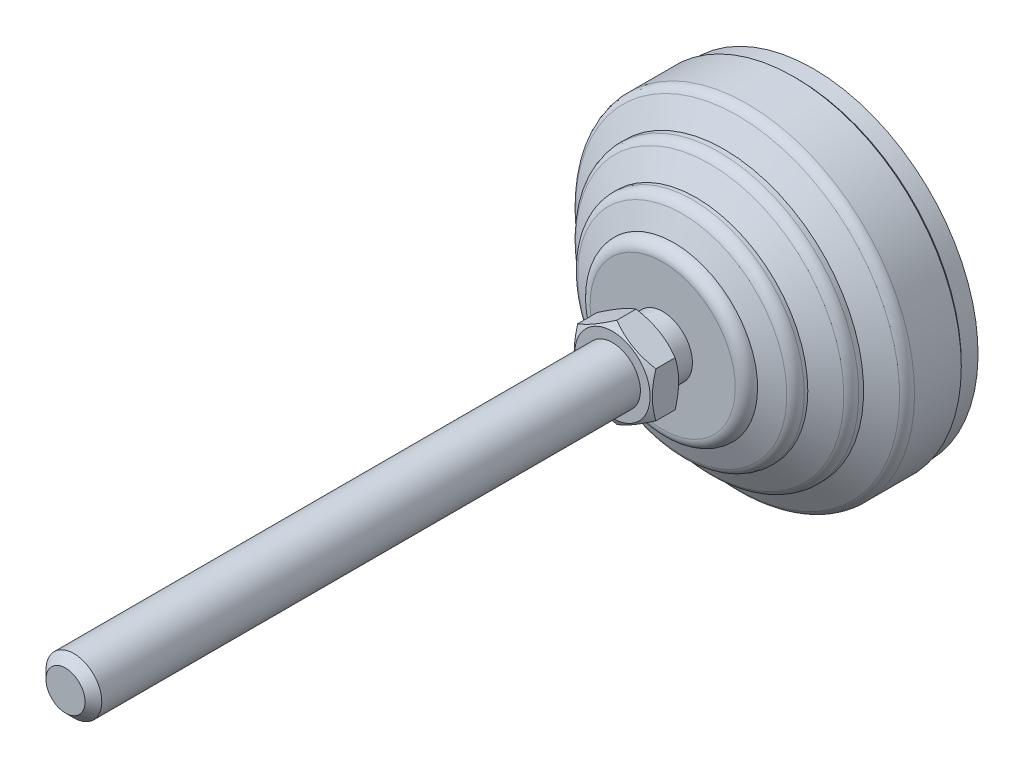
ISO-10303-21;
HEADER;
FILE_DESCRIPTION(('STEP AP214'),'2;1');
FILE_NAME('part.step','',(''),(''),'','','');
FILE_SCHEMA(('AUTOMOTIVE_DESIGN { 1 0 10303 214 1 1 1 1 }'));
ENDSEC;
DATA;
#1=APPLICATION_CONTEXT('core data for automotive mechanical design processes');
#2=APPLICATION_PROTOCOL_DEFINITION('international standard','automotive_design',2000,#1);
#3=PRODUCT_CONTEXT('',#1,'mechanical');
#4=PRODUCT('Part','Part','',(#3));
#5=PRODUCT_RELATED_PRODUCT_CATEGORY('part','',(#4));
#6=PRODUCT_DEFINITION_FORMATION('','',#4);
#7=PRODUCT_DEFINITION_CONTEXT('part definition',#1,'design');
#8=PRODUCT_DEFINITION('design','',#6,#7);
#9=PRODUCT_DEFINITION_SHAPE('','',#8);
#10=(LENGTH_UNIT() NAMED_UNIT(*) SI_UNIT(.MILLI.,.METRE.));
#11=(NAMED_UNIT(*) PLANE_ANGLE_UNIT() SI_UNIT($,.RADIAN.));
#12=(NAMED_UNIT(*) SI_UNIT($,.STERADIAN.) SOLID_ANGLE_UNIT());
#13=UNCERTAINTY_MEASURE_WITH_UNIT(LENGTH_MEASURE(1.E-05),#10,'distance_accuracy_value','');
#14=(GEOMETRIC_REPRESENTATION_CONTEXT(3) GLOBAL_UNCERTAINTY_ASSIGNED_CONTEXT((#13)) GLOBAL_UNIT_ASSIGNED_CONTEXT((#10,
#11,#12)) REPRESENTATION_CONTEXT('',''));
#15=CARTESIAN_POINT('',(0.,0.,0.));
#16=DIRECTION('',(0.,0.,1.));
#17=DIRECTION('',(1.,0.,0.));
#18=AXIS2_PLACEMENT_3D('',#15,#16,#17);
#19=CARTESIAN_POINT('',(-5.32445501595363,0.,31.));
#20=DIRECTION('',(0.,0.,1.));
#21=DIRECTION('',(0.,-1.,0.));
#22=AXIS2_PLACEMENT_3D('',#19,#20,#21);
#23=PLANE('',#22);
#24=CARTESIAN_POINT('',(0.,0.,31.));
#25=DIRECTION('',(0.,0.,-1.));
#26=DIRECTION('',(-1.,0.,0.));
#27=AXIS2_PLACEMENT_3D('',#24,#25,#26);
#28=CIRCLE('',#27,6.75);
#29=CARTESIAN_POINT('',(-6.75,0.,31.));
#30=VERTEX_POINT('',#29);
#31=EDGE_CURVE('E491',#30,#30,#28,.T.);
#32=ORIENTED_EDGE('',*,*,#31,.T.);
#33=EDGE_LOOP('',(#32));
#34=FACE_BOUND('',#33,.T.);
#35=CARTESIAN_POINT('',(0.,0.,31.));
#36=DIRECTION('',(0.,0.,-1.));
#37=DIRECTION('',(0.,1.,0.));
#38=AXIS2_PLACEMENT_3D('',#35,#36,#37);
#39=CIRCLE('',#38,5.32445501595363);
#40=CARTESIAN_POINT('',(0.,5.32445501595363,31.));
#41=VERTEX_POINT('',#40);
#42=EDGE_CURVE('E137',#41,#41,#39,.T.);
#43=ORIENTED_EDGE('',*,*,#42,.F.);
#44=EDGE_LOOP('',(#43));
#45=FACE_BOUND('',#44,.T.);
#46=ADVANCED_FACE('F14',(#34,#45),#23,.F.);
#47=CARTESIAN_POINT('',(0.,0.,0.));
#48=DIRECTION('',(0.,0.,-1.));
#49=DIRECTION('',(0.,1.,0.));
#50=AXIS2_PLACEMENT_3D('',#47,#48,#49);
#51=CYLINDRICAL_SURFACE('',#50,5.32445501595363);
#52=CARTESIAN_POINT('',(0.,0.,27.));
#53=DIRECTION('',(0.,0.,-1.));
#54=DIRECTION('',(0.,1.,0.));
#55=AXIS2_PLACEMENT_3D('',#52,#53,#54);
#56=CIRCLE('',#55,5.32445501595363);
#57=CARTESIAN_POINT('',(0.,5.32445501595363,27.));
#58=VERTEX_POINT('',#57);
#59=EDGE_CURVE('E134',#58,#58,#56,.T.);
#60=ORIENTED_EDGE('',*,*,#59,.F.);
#61=EDGE_LOOP('',(#60));
#62=FACE_BOUND('',#61,.T.);
#63=ORIENTED_EDGE('',*,*,#42,.T.);
#64=EDGE_LOOP('',(#63));
#65=FACE_BOUND('',#64,.T.);
#66=ADVANCED_FACE('F284',(#62,#65),#51,.T.);
#67=CARTESIAN_POINT('',(-13.,0.,27.));
#68=DIRECTION('',(0.,0.,-1.));
#69=DIRECTION('',(0.,1.,0.));
#70=AXIS2_PLACEMENT_3D('',#67,#68,#69);
#71=PLANE('',#70);
#72=CARTESIAN_POINT('',(0.,0.,27.));
#73=DIRECTION('',(0.,0.,-1.));
#74=DIRECTION('',(0.,1.,0.));
#75=AXIS2_PLACEMENT_3D('',#72,#73,#74);
#76=CIRCLE('',#75,13.);
#77=CARTESIAN_POINT('',(0.,13.,27.));
#78=VERTEX_POINT('',#77);
#79=EDGE_CURVE('E131',#78,#78,#76,.T.);
#80=ORIENTED_EDGE('',*,*,#79,.F.);
#81=EDGE_LOOP('',(#80));
#82=FACE_BOUND('',#81,.T.);
#83=ORIENTED_EDGE('',*,*,#59,.T.);
#84=EDGE_LOOP('',(#83));
#85=FACE_BOUND('',#84,.T.);
#86=ADVANCED_FACE('F280',(#82,#85),#71,.F.);
#87=CARTESIAN_POINT('',(0.,0.,25.));
#88=DIRECTION('',(0.,0.,-1.));
#89=DIRECTION('',(0.,1.,0.));
#90=AXIS2_PLACEMENT_3D('',#87,#88,#89);
#91=TOROIDAL_SURFACE('',#90,13.,2.);
#92=CARTESIAN_POINT('',(0.,0.,25.));
#93=DIRECTION('',(0.,0.,-1.));
#94=DIRECTION('',(0.,1.,0.));
#95=AXIS2_PLACEMENT_3D('',#92,#93,#94);
#96=CIRCLE('',#95,15.);
#97=CARTESIAN_POINT('',(0.,15.,25.));
#98=VERTEX_POINT('',#97);
#99=EDGE_CURVE('E128',#98,#98,#96,.T.);
#100=ORIENTED_EDGE('',*,*,#99,.F.);
#101=EDGE_LOOP('',(#100));
#102=FACE_BOUND('',#101,.T.);
#103=ORIENTED_EDGE('',*,*,#79,.T.);
#104=EDGE_LOOP('',(#103));
#105=FACE_BOUND('',#104,.T.);
#106=ADVANCED_FACE('F276',(#102,#105),#91,.T.);
#107=CARTESIAN_POINT('',(0.,0.,25.));
#108=DIRECTION('',(0.,0.,-1.));
#109=DIRECTION('',(0.,1.,0.));
#110=AXIS2_PLACEMENT_3D('',#107,#108,#109);
#111=CONICAL_SURFACE('',#110,15.,1.1902899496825);
#112=CARTESIAN_POINT('',(0.,0.,23.5028874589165));
#113=DIRECTION('',(0.,0.,-1.));
#114=DIRECTION('',(0.,1.,0.));
#115=AXIS2_PLACEMENT_3D('',#112,#113,#114);
#116=CIRCLE('',#115,18.7427813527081);
#117=CARTESIAN_POINT('',(0.,18.7427813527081,23.5028874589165));
#118=VERTEX_POINT('',#117);
#119=EDGE_CURVE('E125',#118,#118,#116,.T.);
#120=ORIENTED_EDGE('',*,*,#119,.F.);
#121=EDGE_LOOP('',(#120));
#122=FACE_BOUND('',#121,.T.);
#123=ORIENTED_EDGE('',*,*,#99,.T.);
#124=EDGE_LOOP('',(#123));
#125=FACE_BOUND('',#124,.T.);
#126=ADVANCED_FACE('F272',(#122,#125),#111,.T.);
#127=CARTESIAN_POINT('',(0.,0.,21.645934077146));
#128=DIRECTION('',(0.,0.,-1.));
#129=DIRECTION('',(0.,1.,0.));
#130=AXIS2_PLACEMENT_3D('',#127,#128,#129);
#131=TOROIDAL_SURFACE('',#130,18.,2.);
#132=CARTESIAN_POINT('',(0.,0.,21.645934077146));
#133=DIRECTION('',(0.,0.,-1.));
#134=DIRECTION('',(0.,1.,0.));
#135=AXIS2_PLACEMENT_3D('',#132,#133,#134);
#136=CIRCLE('',#135,20.);
#137=CARTESIAN_POINT('',(0.,20.,21.645934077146));
#138=VERTEX_POINT('',#137);
#139=EDGE_CURVE('E122',#138,#138,#136,.T.);
#140=ORIENTED_EDGE('',*,*,#139,.F.);
#141=EDGE_LOOP('',(#140));
#142=FACE_BOUND('',#141,.T.);
#143=ORIENTED_EDGE('',*,*,#119,.T.);
#144=EDGE_LOOP('',(#143));
#145=FACE_BOUND('',#144,.T.);
#146=ADVANCED_FACE('F268',(#142,#145),#131,.T.);
#147=CARTESIAN_POINT('',(0.,0.,0.));
#148=DIRECTION('',(0.,0.,-1.));
#149=DIRECTION('',(0.,1.,0.));
#150=AXIS2_PLACEMENT_3D('',#147,#148,#149);
#151=CYLINDRICAL_SURFACE('',#150,20.);
#152=CARTESIAN_POINT('',(0.,0.,21.));
#153=DIRECTION('',(0.,0.,-1.));
#154=DIRECTION('',(0.,1.,0.));
#155=AXIS2_PLACEMENT_3D('',#152,#153,#154);
#156=CIRCLE('',#155,20.);
#157=CARTESIAN_POINT('',(0.,20.,21.));
#158=VERTEX_POINT('',#157);
#159=EDGE_CURVE('E119',#158,#158,#156,.T.);
#160=ORIENTED_EDGE('',*,*,#159,.F.);
#161=EDGE_LOOP('',(#160));
#162=FACE_BOUND('',#161,.T.);
#163=ORIENTED_EDGE('',*,*,#139,.T.);
#164=EDGE_LOOP('',(#163));
#165=FACE_BOUND('',#164,.T.);
#166=ADVANCED_FACE('F264',(#162,#165),#151,.T.);
#167=CARTESIAN_POINT('',(0.,0.,21.));
#168=DIRECTION('',(0.,0.,-1.));
#169=DIRECTION('',(0.,1.,0.));
#170=AXIS2_PLACEMENT_3D('',#167,#168,#169);
#171=CONICAL_SURFACE('',#170,20.,1.0303768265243);
#172=CARTESIAN_POINT('',(0.,0.,18.5826050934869));
#173=DIRECTION('',(0.,0.,-1.));
#174=DIRECTION('',(0.,1.,0.));
#175=AXIS2_PLACEMENT_3D('',#172,#173,#174);
#176=CIRCLE('',#175,24.0289915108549);
#177=CARTESIAN_POINT('',(0.,24.0289915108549,18.5826050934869));
#178=VERTEX_POINT('',#177);
#179=EDGE_CURVE('E116',#178,#178,#176,.T.);
#180=ORIENTED_EDGE('',*,*,#179,.F.);
#181=EDGE_LOOP('',(#180));
#182=FACE_BOUND('',#181,.T.);
#183=ORIENTED_EDGE('',*,*,#159,.T.);
#184=EDGE_LOOP('',(#183));
#185=FACE_BOUND('',#184,.T.);
#186=ADVANCED_FACE('F260',(#182,#185),#171,.T.);
#187=CARTESIAN_POINT('',(0.,0.,16.8676192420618));
#188=DIRECTION('',(0.,0.,-1.));
#189=DIRECTION('',(0.,1.,0.));
#190=AXIS2_PLACEMENT_3D('',#187,#188,#189);
#191=TOROIDAL_SURFACE('',#190,23.,2.);
#192=CARTESIAN_POINT('',(0.,0.,16.8676192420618));
#193=DIRECTION('',(0.,0.,-1.));
#194=DIRECTION('',(0.,1.,0.));
#195=AXIS2_PLACEMENT_3D('',#192,#193,#194);
#196=CIRCLE('',#195,25.);
#197=CARTESIAN_POINT('',(0.,25.,16.8676192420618));
#198=VERTEX_POINT('',#197);
#199=EDGE_CURVE('E113',#198,#198,#196,.T.);
#200=ORIENTED_EDGE('',*,*,#199,.F.);
#201=EDGE_LOOP('',(#200));
#202=FACE_BOUND('',#201,.T.);
#203=ORIENTED_EDGE('',*,*,#179,.T.);
#204=EDGE_LOOP('',(#203));
#205=FACE_BOUND('',#204,.T.);
#206=ADVANCED_FACE('F256',(#202,#205),#191,.T.);
#207=CARTESIAN_POINT('',(0.,0.,0.));
#208=DIRECTION('',(0.,0.,-1.));
#209=DIRECTION('',(0.,1.,0.));
#210=AXIS2_PLACEMENT_3D('',#207,#208,#209);
#211=CYLINDRICAL_SURFACE('',#210,25.);
#212=CARTESIAN_POINT('',(0.,0.,16.));
#213=DIRECTION('',(0.,0.,-1.));
#214=DIRECTION('',(0.,1.,0.));
#215=AXIS2_PLACEMENT_3D('',#212,#213,#214);
#216=CIRCLE('',#215,25.);
#217=CARTESIAN_POINT('',(0.,25.,16.));
#218=VERTEX_POINT('',#217);
#219=EDGE_CURVE('E110',#218,#218,#216,.T.);
#220=ORIENTED_EDGE('',*,*,#219,.F.);
#221=EDGE_LOOP('',(#220));
#222=FACE_BOUND('',#221,.T.);
#223=ORIENTED_EDGE('',*,*,#199,.T.);
#224=EDGE_LOOP('',(#223));
#225=FACE_BOUND('',#224,.T.);
#226=ADVANCED_FACE('F252',(#222,#225),#211,.T.);
#227=CARTESIAN_POINT('',(0.,0.,16.));
#228=DIRECTION('',(0.,0.,-1.));
#229=DIRECTION('',(0.,1.,0.));
#230=AXIS2_PLACEMENT_3D('',#227,#228,#229);
#231=CONICAL_SURFACE('',#230,25.,1.03037682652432);
#232=CARTESIAN_POINT('',(0.,0.,13.5826050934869));
#233=DIRECTION('',(0.,0.,-1.));
#234=DIRECTION('',(0.,1.,0.));
#235=AXIS2_PLACEMENT_3D('',#232,#233,#234);
#236=CIRCLE('',#235,29.0289915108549);
#237=CARTESIAN_POINT('',(0.,29.0289915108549,13.5826050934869));
#238=VERTEX_POINT('',#237);
#239=EDGE_CURVE('E107',#238,#238,#236,.T.);
#240=ORIENTED_EDGE('',*,*,#239,.F.);
#241=EDGE_LOOP('',(#240));
#242=FACE_BOUND('',#241,.T.);
#243=ORIENTED_EDGE('',*,*,#219,.T.);
#244=EDGE_LOOP('',(#243));
#245=FACE_BOUND('',#244,.T.);
#246=ADVANCED_FACE('F248',(#242,#245),#231,.T.);
#247=CARTESIAN_POINT('',(0.,0.,11.8676192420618));
#248=DIRECTION('',(0.,0.,-1.));
#249=DIRECTION('',(0.,1.,0.));
#250=AXIS2_PLACEMENT_3D('',#247,#248,#249);
#251=TOROIDAL_SURFACE('',#250,28.,2.);
#252=CARTESIAN_POINT('',(0.,0.,11.8676192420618));
#253=DIRECTION('',(0.,0.,-1.));
#254=DIRECTION('',(0.,1.,0.));
#255=AXIS2_PLACEMENT_3D('',#252,#253,#254);
#256=CIRCLE('',#255,30.);
#257=CARTESIAN_POINT('',(0.,30.,11.8676192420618));
#258=VERTEX_POINT('',#257);
#259=EDGE_CURVE('E104',#258,#258,#256,.T.);
#260=ORIENTED_EDGE('',*,*,#259,.F.);
#261=EDGE_LOOP('',(#260));
#262=FACE_BOUND('',#261,.T.);
#263=ORIENTED_EDGE('',*,*,#239,.T.);
#264=EDGE_LOOP('',(#263));
#265=FACE_BOUND('',#264,.T.);
#266=ADVANCED_FACE('F244',(#262,#265),#251,.T.);
#267=CARTESIAN_POINT('',(0.,0.,0.));
#268=DIRECTION('',(0.,0.,-1.));
#269=DIRECTION('',(0.,1.,0.));
#270=AXIS2_PLACEMENT_3D('',#267,#268,#269);
#271=CYLINDRICAL_SURFACE('',#270,30.);
#272=CARTESIAN_POINT('',(0.,0.,3.5));
#273=DIRECTION('',(0.,0.,-1.));
#274=DIRECTION('',(0.,1.,0.));
#275=AXIS2_PLACEMENT_3D('',#272,#273,#274);
#276=CIRCLE('',#275,30.);
#277=CARTESIAN_POINT('',(0.,30.,3.5));
#278=VERTEX_POINT('',#277);
#279=EDGE_CURVE('E101',#278,#278,#276,.T.);
#280=ORIENTED_EDGE('',*,*,#279,.F.);
#281=EDGE_LOOP('',(#280));
#282=FACE_BOUND('',#281,.T.);
#283=ORIENTED_EDGE('',*,*,#259,.T.);
#284=EDGE_LOOP('',(#283));
#285=FACE_BOUND('',#284,.T.);
#286=ADVANCED_FACE('F240',(#282,#285),#271,.T.);
#287=CARTESIAN_POINT('',(0.,0.,3.5));
#288=DIRECTION('',(0.,0.,1.));
#289=DIRECTION('',(0.,-1.,0.));
#290=AXIS2_PLACEMENT_3D('',#287,#288,#289);
#291=CONICAL_SURFACE('',#290,30.,0.785398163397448);
#292=CARTESIAN_POINT('',(0.,0.,3.));
#293=DIRECTION('',(0.,0.,-1.));
#294=DIRECTION('',(0.,1.,0.));
#295=AXIS2_PLACEMENT_3D('',#292,#293,#294);
#296=CIRCLE('',#295,29.5);
#297=CARTESIAN_POINT('',(0.,29.5,3.));
#298=VERTEX_POINT('',#297);
#299=EDGE_CURVE('E98',#298,#298,#296,.T.);
#300=ORIENTED_EDGE('',*,*,#299,.F.);
#301=EDGE_LOOP('',(#300));
#302=FACE_BOUND('',#301,.T.);
#303=ORIENTED_EDGE('',*,*,#279,.T.);
#304=EDGE_LOOP('',(#303));
#305=FACE_BOUND('',#304,.T.);
#306=ADVANCED_FACE('F236',(#302,#305),#291,.T.);
#307=CARTESIAN_POINT('',(0.,0.,0.));
#308=DIRECTION('',(0.,0.,-1.));
#309=DIRECTION('',(0.,1.,0.));
#310=AXIS2_PLACEMENT_3D('',#307,#308,#309);
#311=CYLINDRICAL_SURFACE('',#310,29.5);
#312=CARTESIAN_POINT('',(0.,0.,0.));
#313=DIRECTION('',(0.,0.,-1.));
#314=DIRECTION('',(0.,1.,0.));
#315=AXIS2_PLACEMENT_3D('',#312,#313,#314);
#316=CIRCLE('',#315,29.5);
#317=CARTESIAN_POINT('',(0.,29.5,0.));
#318=VERTEX_POINT('',#317);
#319=EDGE_CURVE('E95',#318,#318,#316,.T.);
#320=ORIENTED_EDGE('',*,*,#319,.F.);
#321=EDGE_LOOP('',(#320));
#322=FACE_BOUND('',#321,.T.);
#323=ORIENTED_EDGE('',*,*,#299,.T.);
#324=EDGE_LOOP('',(#323));
#325=FACE_BOUND('',#324,.T.);
#326=ADVANCED_FACE('F232',(#322,#325),#311,.T.);
#327=CARTESIAN_POINT('',(-29.5,0.,0.));
#328=DIRECTION('',(0.,0.,1.));
#329=DIRECTION('',(0.,-1.,0.));
#330=AXIS2_PLACEMENT_3D('',#327,#328,#329);
#331=PLANE('',#330);
#332=ORIENTED_EDGE('',*,*,#319,.T.);
#333=EDGE_LOOP('',(#332));
#334=FACE_BOUND('',#333,.T.);
#335=ADVANCED_FACE('F228',(#334),#331,.F.);
#336=CARTESIAN_POINT('',(0.,0.,32.6864625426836));
#337=DIRECTION('',(0.,0.,1.));
#338=DIRECTION('',(1.,0.,0.));
#339=AXIS2_PLACEMENT_3D('',#336,#337,#338);
#340=CONICAL_SURFACE('',#339,9.67103880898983,1.0471975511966);
#341=CARTESIAN_POINT('',(0.254617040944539,-8.22990698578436,31.8566981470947));
#342=CARTESIAN_POINT('',(-0.0719703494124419,-8.04135166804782,31.7420433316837));
#343=CARTESIAN_POINT('',(-0.401612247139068,-7.85103282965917,31.6371165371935));
#344=CARTESIAN_POINT('',(-1.06727076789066,-7.46671470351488,31.4529294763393));
#345=CARTESIAN_POINT('',(-1.40330422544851,-7.27270569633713,31.3737512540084));
#346=CARTESIAN_POINT('',(-1.90593428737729,-6.98251209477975,31.2803965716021));
#347=CARTESIAN_POINT('',(-2.07078514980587,-6.88733540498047,31.2537331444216));
#348=CARTESIAN_POINT('',(-2.40134856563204,-6.69648452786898,31.208755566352));
#349=CARTESIAN_POINT('',(-2.5670611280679,-6.60081033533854,31.1904415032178));
#350=CARTESIAN_POINT('',(-2.89877829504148,-6.40929333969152,31.1626852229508));
#351=CARTESIAN_POINT('',(-3.06478199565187,-6.31345105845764,31.1532287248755));
#352=CARTESIAN_POINT('',(-3.39699206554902,-6.12164948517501,31.1434068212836));
#353=CARTESIAN_POINT('',(-3.5631984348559,-6.02569019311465,31.1430414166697));
#354=CARTESIAN_POINT('',(-3.90589587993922,-5.8278337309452,31.1516782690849));
#355=CARTESIAN_POINT('',(-4.08237588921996,-5.72594295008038,31.1612715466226));
#356=CARTESIAN_POINT('',(-4.43471511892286,-5.52251980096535,31.1904344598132));
#357=CARTESIAN_POINT('',(-4.61057431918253,-5.42098744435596,31.2100044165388));
#358=CARTESIAN_POINT('',(-4.96164091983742,-5.21829904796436,31.2585695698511));
#359=CARTESIAN_POINT('',(-5.13684647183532,-5.11714407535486,31.2875824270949));
#360=CARTESIAN_POINT('',(-5.48602638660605,-4.91554495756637,31.3542282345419));
#361=CARTESIAN_POINT('',(-5.66000065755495,-4.81510086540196,31.3918618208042));
#362=CARTESIAN_POINT('',(-6.01208776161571,-4.61182328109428,31.4761746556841));
#363=CARTESIAN_POINT('',(-6.19015530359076,-4.50901593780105,31.5231044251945));
#364=CARTESIAN_POINT('',(-6.54475656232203,-4.30428680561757,31.6241859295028));
#365=CARTESIAN_POINT('',(-6.72129011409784,-4.20236511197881,31.6783384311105));
#366=CARTESIAN_POINT('',(-7.07208950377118,-3.99983098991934,31.7926607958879));
#367=CARTESIAN_POINT('',(-7.24636170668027,-3.89921488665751,31.8528047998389));
#368=CARTESIAN_POINT('',(-7.59338732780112,-3.6988595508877,31.9784342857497));
#369=CARTESIAN_POINT('',(-7.76614129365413,-3.59912000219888,32.0439177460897));
#370=CARTESIAN_POINT('',(-7.93820578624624,-3.49977852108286,32.1116633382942));
#371=B_SPLINE_CURVE_WITH_KNOTS('',3,(#341,#342,#343,#344,#345,#346,#347,#348,#349,#350,#351,
#352,#353,#354,#355,#356,#357,#358,#359,#360,#361,#362,#363,#364,#365,#366,#367,#368,#369,#370),
.UNSPECIFIED.,.F.,.F.,(4,2,2,2,2,2,2,2,2,2,2,2,2,2,4),(0.,1.18320924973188,2.37015249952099,
2.94661879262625,3.523091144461,4.09863244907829,4.67417381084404,5.28593805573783,
5.89772198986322,6.51065675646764,7.1236367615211,7.75619487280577,8.38882019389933,
9.01882456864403,9.64859150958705),.UNSPECIFIED.);
#372=CARTESIAN_POINT('',(0.,-8.08290376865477,31.7695523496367));
#373=VERTEX_POINT('',#372);
#374=CARTESIAN_POINT('',(-7.,-4.04145188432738,31.7695523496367));
#375=VERTEX_POINT('',#374);
#376=EDGE_CURVE('E73',#373,#375,#371,.T.);
#377=ORIENTED_EDGE('',*,*,#376,.T.);
#378=CARTESIAN_POINT('',(-7.,-10.826054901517,34.5460808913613));
#379=CARTESIAN_POINT('',(-7.,-10.5205663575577,34.3980115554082));
#380=CARTESIAN_POINT('',(-7.,-10.2143733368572,34.2513706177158));
#381=CARTESIAN_POINT('',(-7.,-9.60020357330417,33.9617495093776));
#382=CARTESIAN_POINT('',(-7.,-9.29222655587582,33.8187699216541));
#383=CARTESIAN_POINT('',(-7.,-8.67251292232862,33.5365497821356));
#384=CARTESIAN_POINT('',(-7.,-8.3607649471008,33.3973340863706));
#385=CARTESIAN_POINT('',(-7.,-7.73477904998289,33.1246398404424));
#386=CARTESIAN_POINT('',(-7.,-7.42054124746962,32.991161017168));
#387=CARTESIAN_POINT('',(-7.,-6.77905019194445,32.7273329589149));
#388=CARTESIAN_POINT('',(-7.,-6.45170030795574,32.5972173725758));
#389=CARTESIAN_POINT('',(-7.,-5.79316058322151,32.3469061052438));
#390=CARTESIAN_POINT('',(-7.,-5.46197031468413,32.2267115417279));
#391=CARTESIAN_POINT('',(-7.,-4.79584847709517,31.9994198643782));
#392=CARTESIAN_POINT('',(-7.,-4.46092614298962,31.8922959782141));
#393=CARTESIAN_POINT('',(-7.,-3.78628952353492,31.6946012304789));
#394=CARTESIAN_POINT('',(-7.,-3.44657679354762,31.6040251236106));
#395=CARTESIAN_POINT('',(-7.,-2.76398857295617,31.4442782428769));
#396=CARTESIAN_POINT('',(-7.,-2.42114071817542,31.3749925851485));
#397=CARTESIAN_POINT('',(-7.,-1.9037708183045,31.29004662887));
#398=CARTESIAN_POINT('',(-7.,-1.73078490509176,31.2648939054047));
#399=CARTESIAN_POINT('',(-7.,-1.38396341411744,31.2214099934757));
#400=CARTESIAN_POINT('',(-7.,-1.21012791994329,31.2030781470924));
#401=CARTESIAN_POINT('',(-7.,-0.864098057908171,31.1738295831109));
#402=CARTESIAN_POINT('',(-7.,-0.691911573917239,31.1628199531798));
#403=CARTESIAN_POINT('',(-7.,-0.347227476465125,31.1480899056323));
#404=CARTESIAN_POINT('',(-7.,-0.174729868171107,31.1443693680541));
#405=CARTESIAN_POINT('',(-7.,0.170268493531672,31.1443061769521));
#406=CARTESIAN_POINT('',(-7.,0.342769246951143,31.1479635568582));
#407=CARTESIAN_POINT('',(-7.,0.687464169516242,31.1625673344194));
#408=CARTESIAN_POINT('',(-7.,0.859658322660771,31.1735141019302));
#409=CARTESIAN_POINT('',(-7.,1.27439912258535,31.2084281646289));
#410=CARTESIAN_POINT('',(-7.,1.51665651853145,31.2359043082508));
#411=CARTESIAN_POINT('',(-7.,1.99934226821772,31.3037786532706));
#412=CARTESIAN_POINT('',(-7.,2.23977036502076,31.3441786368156));
#413=CARTESIAN_POINT('',(-7.,2.95805317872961,31.4826194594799));
#414=CARTESIAN_POINT('',(-7.,3.43263211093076,31.5978750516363));
#415=CARTESIAN_POINT('',(-7.,4.1422167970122,31.7973500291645));
#416=CARTESIAN_POINT('',(-7.,4.38091286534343,31.869193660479));
#417=CARTESIAN_POINT('',(-7.,4.85598593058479,32.0202460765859));
#418=CARTESIAN_POINT('',(-7.,5.09236291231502,32.0994549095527));
#419=CARTESIAN_POINT('',(-7.,5.56287405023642,32.2639748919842));
#420=CARTESIAN_POINT('',(-7.,5.79700893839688,32.34928396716));
#421=CARTESIAN_POINT('',(-7.,6.26334533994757,32.525010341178));
#422=CARTESIAN_POINT('',(-7.,6.49554687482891,32.6154275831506));
#423=CARTESIAN_POINT('',(-7.,7.03883470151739,32.8327645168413));
#424=CARTESIAN_POINT('',(-7.,7.34922224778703,32.9614275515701));
#425=CARTESIAN_POINT('',(-7.,7.96739921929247,33.2248681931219));
#426=CARTESIAN_POINT('',(-7.,8.27518849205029,33.3596461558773));
#427=CARTESIAN_POINT('',(-7.,8.88864068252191,33.6341017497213));
#428=CARTESIAN_POINT('',(-7.,9.19430317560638,33.7737803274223));
#429=CARTESIAN_POINT('',(-7.,9.80380489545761,34.0570673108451));
#430=CARTESIAN_POINT('',(-7.,10.1076440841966,34.200675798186));
#431=CARTESIAN_POINT('',(-7.,10.714103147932,34.4912401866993));
#432=CARTESIAN_POINT('',(-7.,11.0167214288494,34.6381994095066));
#433=CARTESIAN_POINT('',(-7.,11.6206630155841,34.9347574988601));
#434=CARTESIAN_POINT('',(-7.,11.921986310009,35.0843563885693));
#435=CARTESIAN_POINT('',(-7.,12.8242429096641,35.5363786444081));
#436=CARTESIAN_POINT('',(-7.,13.4235411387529,35.8420653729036));
#437=CARTESIAN_POINT('',(-7.,14.5695933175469,36.434077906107));
#438=CARTESIAN_POINT('',(-7.,15.116599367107,36.7199178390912));
#439=CARTESIAN_POINT('',(-7.,16.2085754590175,37.2955025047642));
#440=CARTESIAN_POINT('',(-7.,16.7535454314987,37.5852473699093));
#441=CARTESIAN_POINT('',(-7.,17.8405722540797,38.167008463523));
#442=CARTESIAN_POINT('',(-7.,18.3826329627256,38.459017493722));
#443=CARTESIAN_POINT('',(-7.,19.4654499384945,39.0453760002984));
#444=CARTESIAN_POINT('',(-7.,20.0062062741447,39.339725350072));
#445=CARTESIAN_POINT('',(-7.,20.5464812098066,39.6349497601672));
#446=B_SPLINE_CURVE_WITH_KNOTS('',3,(#378,#379,#380,#381,#382,#383,#384,#385,#386,#387,#388,
#389,#390,#391,#392,#393,#394,#395,#396,#397,#398,#399,#400,#401,#402,#403,#404,#405,#406,#407,
#408,#409,#410,#411,#412,#413,#414,#415,#416,#417,#418,#419,#420,#421,#422,#423,#424,#425,#426,
#427,#428,#429,#430,#431,#432,#433,#434,#435,#436,#437,#438,#439,#440,#441,#442,#443,#444,#445),
.UNSPECIFIED.,.F.,.F.,(4,2,2,2,2,2,2,2,2,2,2,2,2,2,2,2,2,2,2,2,2,2,2,2,2,2,2,2,2,2,2,2,2,4),(0.,
1.01845747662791,2.03707610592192,3.06129065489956,4.08545639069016,5.14211548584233,
6.19889343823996,7.25346912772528,8.30770995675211,9.35615791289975,9.88045956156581,
10.4047106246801,10.922175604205,11.439632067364,11.9570908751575,12.4745759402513,
13.2055938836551,13.9367126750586,15.3997732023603,16.1475327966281,16.8952972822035,
17.6428087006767,18.3903117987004,19.3982177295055,20.4061824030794,21.4143428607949,
22.4225242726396,23.4317527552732,24.4409900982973,26.4592042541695,28.3107491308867,
30.1623569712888,32.0094815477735,33.8565068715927),.UNSPECIFIED.);
#447=CARTESIAN_POINT('',(-7.,4.04145188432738,31.7695523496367));
#448=VERTEX_POINT('',#447);
#449=EDGE_CURVE('E81',#375,#448,#446,.T.);
#450=ORIENTED_EDGE('',*,*,#449,.T.);
#451=CARTESIAN_POINT('',(-12.7258004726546,0.735659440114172,34.4623963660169));
#452=CARTESIAN_POINT('',(-12.4561619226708,0.891335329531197,34.3122134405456));
#453=CARTESIAN_POINT('',(-12.185870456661,1.04738818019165,34.1635637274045));
#454=CARTESIAN_POINT('',(-11.6436199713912,1.36045664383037,33.8702266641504));
#455=CARTESIAN_POINT('',(-11.3716606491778,1.51747243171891,33.7255400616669));
#456=CARTESIAN_POINT('',(-10.8240897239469,1.83361265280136,33.4401837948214));
#457=CARTESIAN_POINT('',(-10.5484659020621,1.99274414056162,33.2995452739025));
#458=CARTESIAN_POINT('',(-9.9948792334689,2.31235755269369,33.0245721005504));
#459=CARTESIAN_POINT('',(-9.71691652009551,2.47283940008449,32.890237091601));
#460=CARTESIAN_POINT('',(-9.15549358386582,2.79697708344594,32.6283415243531));
#461=CARTESIAN_POINT('',(-8.87200620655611,2.96064859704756,32.5008581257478));
#462=CARTESIAN_POINT('',(-8.30158359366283,3.28998224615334,32.2564150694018));
#463=CARTESIAN_POINT('',(-8.01464794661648,3.45564461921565,32.1394566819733));
#464=CARTESIAN_POINT('',(-7.43752984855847,3.78884390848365,31.9194429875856));
#465=CARTESIAN_POINT('',(-7.14735691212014,3.95637533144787,31.8163547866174));
#466=CARTESIAN_POINT('',(-6.56283245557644,4.29385068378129,31.6276617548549));
#467=CARTESIAN_POINT('',(-6.26848243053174,4.46379374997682,31.5420508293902));
#468=CARTESIAN_POINT('',(-5.68097241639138,4.80299281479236,31.3941798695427));
#469=CARTESIAN_POINT('',(-5.38789023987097,4.9722038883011,31.331519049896));
#470=CARTESIAN_POINT('',(-4.94584642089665,5.22741800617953,31.256604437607));
#471=CARTESIAN_POINT('',(-4.79807558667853,5.31273353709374,31.2348107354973));
#472=CARTESIAN_POINT('',(-4.50190576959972,5.48372726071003,31.1980139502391));
#473=CARTESIAN_POINT('',(-4.35350684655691,5.56940541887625,31.1830102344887));
#474=CARTESIAN_POINT('',(-4.05714008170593,5.74051285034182,31.1601897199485));
#475=CARTESIAN_POINT('',(-3.90917457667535,5.825940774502,31.1523325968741));
#476=CARTESIAN_POINT('',(-3.61308906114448,5.9968858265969,31.1438379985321));
#477=CARTESIAN_POINT('',(-3.46496905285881,6.082402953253,31.1432004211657));
#478=CARTESIAN_POINT('',(-3.16887570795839,6.25335252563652,31.1491598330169));
#479=CARTESIAN_POINT('',(-3.02090234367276,6.33878498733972,31.1557549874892));
#480=CARTESIAN_POINT('',(-2.72531732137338,6.50944107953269,31.1760230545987));
#481=CARTESIAN_POINT('',(-2.57770568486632,6.59466469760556,31.1896963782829));
#482=CARTESIAN_POINT('',(-2.21404438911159,6.8046246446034,31.2318261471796));
#483=CARTESIAN_POINT('',(-1.99832964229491,6.92916761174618,31.2642072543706));
#484=CARTESIAN_POINT('',(-1.56871456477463,7.17720599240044,31.342230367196));
#485=CARTESIAN_POINT('',(-1.35481453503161,7.30070123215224,31.3878745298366));
#486=CARTESIAN_POINT('',(-0.715400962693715,7.66986683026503,31.5423951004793));
#487=CARTESIAN_POINT('',(-0.293025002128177,7.91372570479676,31.6687488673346));
#488=CARTESIAN_POINT('',(0.338470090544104,8.27831956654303,31.8848088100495));
#489=CARTESIAN_POINT('',(0.550923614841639,8.4009796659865,31.9622439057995));
#490=CARTESIAN_POINT('',(0.973779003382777,8.64511533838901,32.1243856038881));
#491=CARTESIAN_POINT('',(1.18418068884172,8.76659080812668,32.2090928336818));
#492=CARTESIAN_POINT('',(1.60187745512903,9.0077481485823,32.383998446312));
#493=CARTESIAN_POINT('',(1.80918344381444,9.12743631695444,32.4741624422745));
#494=CARTESIAN_POINT('',(2.22206069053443,9.3658111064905,32.6594194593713));
#495=CARTESIAN_POINT('',(2.42763250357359,9.48449804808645,32.7545108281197));
#496=CARTESIAN_POINT('',(2.63247885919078,9.60276614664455,32.8515974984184));
#497=B_SPLINE_CURVE_WITH_KNOTS('',3,(#451,#452,#453,#454,#455,#456,#457,#458,#459,#460,#461,
#462,#463,#464,#465,#466,#467,#468,#469,#470,#471,#472,#473,#474,#475,#476,#477,#478,#479,#480,
#481,#482,#483,#484,#485,#486,#487,#488,#489,#490,#491,#492,#493,#494,#495,#496),.UNSPECIFIED.,
.F.,.F.,(4,2,2,2,2,2,2,2,2,2,2,2,2,2,2,2,2,2,2,2,2,2,4),(0.,1.03705591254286,2.07430613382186,
3.11810774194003,4.16185024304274,5.2155841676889,6.26944510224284,7.32076094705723,
8.37170954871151,9.40331480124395,9.91925229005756,10.435141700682,10.948101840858,
11.4610547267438,11.9738775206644,12.4867300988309,13.2398432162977,13.9930788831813,
15.5025040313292,16.2742039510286,17.0459705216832,17.8132979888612,18.5803697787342),.UNSPECIFIED.);
#498=CARTESIAN_POINT('',(0.,8.08290376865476,31.7695523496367));
#499=VERTEX_POINT('',#498);
#500=EDGE_CURVE('E215',#448,#499,#497,.T.);
#501=ORIENTED_EDGE('',*,*,#500,.T.);
#502=CARTESIAN_POINT('',(-0.945865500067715,8.62899946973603,32.1146815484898));
#503=CARTESIAN_POINT('',(-0.773691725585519,8.52959489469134,32.0468168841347));
#504=CARTESIAN_POINT('',(-0.600828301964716,8.42979215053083,31.9812124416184));
#505=CARTESIAN_POINT('',(-0.253582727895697,8.22930982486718,31.8553376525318));
#506=CARTESIAN_POINT('',(-0.0792000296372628,8.12862992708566,31.7950693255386));
#507=CARTESIAN_POINT('',(0.271824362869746,7.92596589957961,31.6804943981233));
#508=CARTESIAN_POINT('',(0.448472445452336,7.82397808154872,31.6262137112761));
#509=CARTESIAN_POINT('',(0.803305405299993,7.61911517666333,31.5248744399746));
#510=CARTESIAN_POINT('',(0.98149011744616,7.51624018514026,31.4778150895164));
#511=CARTESIAN_POINT('',(1.33380774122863,7.3128295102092,31.3932486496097));
#512=CARTESIAN_POINT('',(1.50789522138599,7.21232005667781,31.3554908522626));
#513=CARTESIAN_POINT('',(1.85730569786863,7.01058782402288,31.2885995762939));
#514=CARTESIAN_POINT('',(2.03262860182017,6.90936509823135,31.2594654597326));
#515=CARTESIAN_POINT('',(2.38393397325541,6.70653884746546,31.2106644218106));
#516=CARTESIAN_POINT('',(2.55991458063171,6.60493639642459,31.1909798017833));
#517=CARTESIAN_POINT('',(2.91250147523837,6.4013702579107,31.1615976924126));
#518=CARTESIAN_POINT('',(3.08910774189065,6.29940658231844,31.1518998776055));
#519=CARTESIAN_POINT('',(3.43183946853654,6.1015303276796,31.143079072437));
#520=CARTESIAN_POINT('',(3.59795338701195,6.00562441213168,31.1433524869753));
#521=CARTESIAN_POINT('',(3.92998259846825,5.81392725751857,31.1529817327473));
#522=CARTESIAN_POINT('',(4.09589789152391,5.71813601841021,31.1623375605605));
#523=CARTESIAN_POINT('',(4.42744174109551,5.52671908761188,31.1898867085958));
#524=CARTESIAN_POINT('',(4.5930694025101,5.43109391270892,31.2080942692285));
#525=CARTESIAN_POINT('',(4.92346698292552,5.24033878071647,31.2528560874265));
#526=CARTESIAN_POINT('',(5.08823691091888,5.14520881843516,31.2794102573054));
#527=CARTESIAN_POINT('',(5.59061554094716,4.85516038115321,31.3724292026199));
#528=CARTESIAN_POINT('',(5.92648410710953,4.66124657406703,31.4513802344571));
#529=CARTESIAN_POINT('',(6.59182548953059,4.27711154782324,31.6351253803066));
#530=CARTESIAN_POINT('',(6.9213150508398,4.08688066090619,31.7398377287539));
#531=CARTESIAN_POINT('',(7.24775088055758,3.8984128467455,31.8542895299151));
#532=B_SPLINE_CURVE_WITH_KNOTS('',3,(#502,#503,#504,#505,#506,#507,#508,#509,#510,#511,#512,
#513,#514,#515,#516,#517,#518,#519,#520,#521,#522,#523,#524,#525,#526,#527,#528,#529,#530,#531),
.UNSPECIFIED.,.F.,.F.,(4,2,2,2,2,2,2,2,2,2,2,2,2,2,4),(0.,0.630240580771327,1.26071868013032,
1.89382637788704,2.52686687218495,3.14030106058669,3.75368985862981,4.36592526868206,
4.97814072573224,5.55336177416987,6.12858260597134,6.70473191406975,7.28087516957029,
8.46712159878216,9.64965042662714),.UNSPECIFIED.);
#533=CARTESIAN_POINT('',(7.,4.04145188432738,31.7695523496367));
#534=VERTEX_POINT('',#533);
#535=EDGE_CURVE('E481',#499,#534,#532,.T.);
#536=ORIENTED_EDGE('',*,*,#535,.T.);
#537=CARTESIAN_POINT('',(7.,-10.8260549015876,34.5460808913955));
#538=CARTESIAN_POINT('',(7.,-10.5205663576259,34.3980115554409));
#539=CARTESIAN_POINT('',(7.,-10.214373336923,34.2513706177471));
#540=CARTESIAN_POINT('',(7.,-9.60020357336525,33.9617495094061));
#541=CARTESIAN_POINT('',(7.,-9.29222655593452,33.8187699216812));
#542=CARTESIAN_POINT('',(7.,-8.67251292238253,33.5365497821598));
#543=CARTESIAN_POINT('',(7.,-8.36076494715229,33.3973340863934));
#544=CARTESIAN_POINT('',(7.,-7.73477905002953,33.1246398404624));
#545=CARTESIAN_POINT('',(7.,-7.42054124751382,32.9911610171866));
#546=CARTESIAN_POINT('',(7.,-6.7790501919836,32.7273329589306));
#547=CARTESIAN_POINT('',(7.,-6.45170030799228,32.5972173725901));
#548=CARTESIAN_POINT('',(7.,-5.79316058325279,32.3469061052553));
#549=CARTESIAN_POINT('',(7.,-5.46197031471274,32.226711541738));
#550=CARTESIAN_POINT('',(7.,-4.79584847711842,31.9994198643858));
#551=CARTESIAN_POINT('',(7.,-4.46092614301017,31.8922959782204));
#552=CARTESIAN_POINT('',(7.,-3.78628952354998,31.694601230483));
#553=CARTESIAN_POINT('',(7.,-3.44657679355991,31.6040251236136));
#554=CARTESIAN_POINT('',(7.,-2.76398857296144,31.4442782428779));
#555=CARTESIAN_POINT('',(7.,-2.42114071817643,31.3749925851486));
#556=CARTESIAN_POINT('',(7.,-1.90377081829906,31.2900466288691));
#557=CARTESIAN_POINT('',(7.,-1.73078490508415,31.2648939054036));
#558=CARTESIAN_POINT('',(7.,-1.38396341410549,31.2214099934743));
#559=CARTESIAN_POINT('',(7.,-1.21012791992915,31.203078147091));
#560=CARTESIAN_POINT('',(7.,-0.864098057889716,31.1738295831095));
#561=CARTESIAN_POINT('',(7.,-0.691911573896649,31.1628199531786));
#562=CARTESIAN_POINT('',(7.,-0.347227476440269,31.1480899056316));
#563=CARTESIAN_POINT('',(7.,-0.17472986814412,31.1443693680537));
#564=CARTESIAN_POINT('',(7.,0.170268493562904,31.1443061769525));
#565=CARTESIAN_POINT('',(7.,0.342769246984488,31.1479635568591));
#566=CARTESIAN_POINT('',(7.,0.687464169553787,31.1625673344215));
#567=CARTESIAN_POINT('',(7.,0.859658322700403,31.1735141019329));
#568=CARTESIAN_POINT('',(7.,1.27439912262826,31.2084281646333));
#569=CARTESIAN_POINT('',(7.,1.51665651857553,31.2359043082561));
#570=CARTESIAN_POINT('',(7.,1.99934226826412,31.303778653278));
#571=CARTESIAN_POINT('',(7.,2.23977036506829,31.344178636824));
#572=CARTESIAN_POINT('',(7.,2.95805317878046,31.4826194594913));
#573=CARTESIAN_POINT('',(7.,3.43263211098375,31.5978750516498));
#574=CARTESIAN_POINT('',(7.,4.14221679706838,31.797350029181));
#575=CARTESIAN_POINT('',(7.,4.38091286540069,31.8691936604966));
#576=CARTESIAN_POINT('',(7.,4.85598593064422,32.0202460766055));
#577=CARTESIAN_POINT('',(7.,5.09236291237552,32.0994549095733));
#578=CARTESIAN_POINT('',(7.,5.56287405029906,32.2639748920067));
#579=CARTESIAN_POINT('',(7.,5.7970089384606,32.3492839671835));
#580=CARTESIAN_POINT('',(7.,6.26334534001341,32.5250103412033));
#581=CARTESIAN_POINT('',(7.,6.49554687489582,32.6154275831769));
#582=CARTESIAN_POINT('',(7.,7.03883470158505,32.832764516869));
#583=CARTESIAN_POINT('',(7.,7.34922224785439,32.9614275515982));
#584=CARTESIAN_POINT('',(7.,7.96739921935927,33.2248681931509));
#585=CARTESIAN_POINT('',(7.,8.27518849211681,33.3596461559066));
#586=CARTESIAN_POINT('',(7.,8.88864068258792,33.6341017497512));
#587=CARTESIAN_POINT('',(7.,9.19430317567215,33.7737803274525));
#588=CARTESIAN_POINT('',(7.,9.80380489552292,34.0570673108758));
#589=CARTESIAN_POINT('',(7.,10.1076440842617,34.2006757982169));
#590=CARTESIAN_POINT('',(7.,10.7141031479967,34.4912401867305));
#591=CARTESIAN_POINT('',(7.,11.0167214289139,34.6381994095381));
#592=CARTESIAN_POINT('',(7.,11.6206630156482,34.9347574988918));
#593=CARTESIAN_POINT('',(7.,11.9219863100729,35.0843563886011));
#594=CARTESIAN_POINT('',(7.,12.8242429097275,35.5363786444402));
#595=CARTESIAN_POINT('',(7.,13.4235411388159,35.8420653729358));
#596=CARTESIAN_POINT('',(7.,14.5695933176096,36.4340779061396));
#597=CARTESIAN_POINT('',(7.,15.1165993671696,36.719917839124));
#598=CARTESIAN_POINT('',(7.,16.2085754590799,37.2955025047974));
#599=CARTESIAN_POINT('',(7.,16.7535454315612,37.5852473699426));
#600=CARTESIAN_POINT('',(7.,17.8405722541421,38.1670084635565));
#601=CARTESIAN_POINT('',(7.,18.3826329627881,38.4590174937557));
#602=CARTESIAN_POINT('',(7.,19.465449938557,39.0453760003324));
#603=CARTESIAN_POINT('',(7.,20.0062062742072,39.3397253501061));
#604=CARTESIAN_POINT('',(7.,20.5464812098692,39.6349497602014));
#605=B_SPLINE_CURVE_WITH_KNOTS('',3,(#537,#538,#539,#540,#541,#542,#543,#544,#545,#546,#547,
#548,#549,#550,#551,#552,#553,#554,#555,#556,#557,#558,#559,#560,#561,#562,#563,#564,#565,#566,
#567,#568,#569,#570,#571,#572,#573,#574,#575,#576,#577,#578,#579,#580,#581,#582,#583,#584,#585,
#586,#587,#588,#589,#590,#591,#592,#593,#594,#595,#596,#597,#598,#599,#600,#601,#602,#603,#604),
.UNSPECIFIED.,.F.,.F.,(4,2,2,2,2,2,2,2,2,2,2,2,2,2,2,2,2,2,2,2,2,2,2,2,2,2,2,2,2,2,2,2,2,4),(0.,
1.01845747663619,2.03707610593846,3.06129065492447,4.08545639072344,5.14211548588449,
6.19889343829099,7.25346912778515,8.30770995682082,9.35615791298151,9.88045956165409,
10.4047106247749,10.9221756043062,11.4396320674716,11.9570908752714,12.4745759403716,
13.2055938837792,13.9367126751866,15.3997732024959,16.1475327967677,16.8952972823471,
17.6428087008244,18.390311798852,19.3982177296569,20.4061824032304,21.4143428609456,
22.42252427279,23.4317527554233,24.440990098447,26.4592042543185,28.3107491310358,
30.162356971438,32.009481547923,33.8565068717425),.UNSPECIFIED.);
#606=CARTESIAN_POINT('',(7.,-4.04145188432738,31.7695523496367));
#607=VERTEX_POINT('',#606);
#608=EDGE_CURVE('E34',#534,#607,#605,.F.);
#609=ORIENTED_EDGE('',*,*,#608,.T.);
#610=CARTESIAN_POINT('',(-5.73206379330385,-11.3923123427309,34.4658863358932));
#611=CARTESIAN_POINT('',(-5.46246583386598,-11.2366598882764,34.3156951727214));
#612=CARTESIAN_POINT('',(-5.19221599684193,-11.0806310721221,34.1670345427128));
#613=CARTESIAN_POINT('',(-4.65005164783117,-10.7676123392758,33.873668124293));
#614=CARTESIAN_POINT('',(-4.378136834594,-10.6106222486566,33.7289630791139));
#615=CARTESIAN_POINT('',(-3.83066516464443,-10.2945393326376,33.443563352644));
#616=CARTESIAN_POINT('',(-3.55509615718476,-10.1354394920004,33.3028996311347));
#617=CARTESIAN_POINT('',(-3.00162320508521,-9.81589173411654,33.0278622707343));
#618=CARTESIAN_POINT('',(-2.72371939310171,-9.65544389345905,32.8934882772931));
#619=CARTESIAN_POINT('',(-2.16237676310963,-9.33135257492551,32.6314757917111));
#620=CARTESIAN_POINT('',(-1.87891039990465,-9.16769319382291,32.5039155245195));
#621=CARTESIAN_POINT('',(-1.30853423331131,-8.8383863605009,32.2592972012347));
#622=CARTESIAN_POINT('',(-1.02162401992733,-8.6727386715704,32.1422404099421));
#623=CARTESIAN_POINT('',(-0.444557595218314,-8.33956921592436,31.9220012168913));
#624=CARTESIAN_POINT('',(-0.154410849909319,-8.17205291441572,31.8187861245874));
#625=CARTESIAN_POINT('',(0.430060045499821,-7.83460848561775,31.6298057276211));
#626=CARTESIAN_POINT('',(0.724382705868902,-7.66468121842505,31.5440343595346));
#627=CARTESIAN_POINT('',(1.31195709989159,-7.32544498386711,31.3957800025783));
#628=CARTESIAN_POINT('',(1.60513259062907,-7.15618003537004,31.332905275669));
#629=CARTESIAN_POINT('',(2.04732534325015,-6.90087993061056,31.2576630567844));
#630=CARTESIAN_POINT('',(2.19514724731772,-6.81553491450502,31.2357590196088));
#631=CARTESIAN_POINT('',(2.49142275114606,-6.64448017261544,31.198741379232));
#632=CARTESIAN_POINT('',(2.63987629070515,-6.55877048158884,31.1836271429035));
#633=CARTESIAN_POINT('',(2.93635049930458,-6.38760101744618,31.1605887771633));
#634=CARTESIAN_POINT('',(3.0843687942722,-6.30214261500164,31.1526240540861));
#635=CARTESIAN_POINT('',(3.3805638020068,-6.13113434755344,31.1439183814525));
#636=CARTESIAN_POINT('',(3.52874051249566,-6.04558448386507,31.1431773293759));
#637=CARTESIAN_POINT('',(3.82495070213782,-5.87456745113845,31.1489363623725));
#638=CARTESIAN_POINT('',(3.97298420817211,-5.78910026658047,31.1554346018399));
#639=CARTESIAN_POINT('',(4.26869254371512,-5.6183729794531,31.1755174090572));
#640=CARTESIAN_POINT('',(4.41636735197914,-5.53311288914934,31.1891023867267));
#641=CARTESIAN_POINT('',(4.77987445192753,-5.3232419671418,31.2309904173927));
#642=CARTESIAN_POINT('',(4.99537494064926,-5.19882270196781,31.2632027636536));
#643=CARTESIAN_POINT('',(5.42456949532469,-4.95102711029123,31.3408758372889));
#644=CARTESIAN_POINT('',(5.6382632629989,-4.82765095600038,31.3863387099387));
#645=CARTESIAN_POINT('',(6.27706641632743,-4.45883778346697,31.5403066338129));
#646=CARTESIAN_POINT('',(6.69904819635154,-4.21520648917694,31.6662810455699));
#647=CARTESIAN_POINT('',(7.32997126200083,-3.85094288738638,31.8817798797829));
#648=CARTESIAN_POINT('',(7.5422422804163,-3.72838815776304,31.9590302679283));
#649=CARTESIAN_POINT('',(7.96473428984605,-3.48446228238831,32.1208070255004));
#650=CARTESIAN_POINT('',(8.17495510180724,-3.36309124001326,32.2053340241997));
#651=CARTESIAN_POINT('',(8.59229290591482,-3.12214114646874,32.3798856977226));
#652=CARTESIAN_POINT('',(8.7994207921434,-3.00255580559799,32.4698759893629));
#653=CARTESIAN_POINT('',(9.21194177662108,-2.76438670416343,32.6547904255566));
#654=CARTESIAN_POINT('',(9.41733543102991,-2.64580262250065,32.749712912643));
#655=CARTESIAN_POINT('',(9.62200336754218,-2.52763753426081,32.8466330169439));
#656=B_SPLINE_CURVE_WITH_KNOTS('',3,(#610,#611,#612,#613,#614,#615,#616,#617,#618,#619,#620,
#621,#622,#623,#624,#625,#626,#627,#628,#629,#630,#631,#632,#633,#634,#635,#636,#637,#638,#639,
#640,#641,#642,#643,#644,#645,#646,#647,#648,#649,#650,#651,#652,#653,#654,#655),.UNSPECIFIED.,
.F.,.F.,(4,2,2,2,2,2,2,2,2,2,2,2,2,2,2,2,2,2,2,2,2,2,4),(0.,1.036939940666,2.0740733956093,
3.11773210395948,4.16133191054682,5.21508225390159,6.26895931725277,7.32030183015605,
8.37127827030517,9.40331959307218,9.91947464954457,10.4355815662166,10.9487392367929,
11.4618896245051,11.9749092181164,12.4879584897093,13.2402711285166,13.9927056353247,
15.5005226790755,16.2714527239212,17.0424495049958,17.8090158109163,18.5753261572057),.UNSPECIFIED.);
#657=EDGE_CURVE('E9',#607,#373,#656,.F.);
#658=ORIENTED_EDGE('',*,*,#657,.T.);
#659=EDGE_LOOP('',(#377,#450,#501,#536,#609,#658));
#660=FACE_BOUND('',#659,.T.);
#661=ORIENTED_EDGE('',*,*,#31,.F.);
#662=EDGE_LOOP('',(#661));
#663=FACE_BOUND('',#662,.T.);
#664=ADVANCED_FACE('F71',(#660,#663),#340,.T.);
#665=CARTESIAN_POINT('',(-3.32445501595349,0.,134.));
#666=DIRECTION('',(0.,0.,-1.));
#667=DIRECTION('',(0.,1.,0.));
#668=AXIS2_PLACEMENT_3D('',#665,#666,#667);
#669=PLANE('',#668);
#670=CARTESIAN_POINT('',(0.,0.,134.));
#671=DIRECTION('',(0.,0.,-1.));
#672=DIRECTION('',(0.,1.,0.));
#673=AXIS2_PLACEMENT_3D('',#670,#671,#672);
#674=CIRCLE('',#673,3.5);
#675=CARTESIAN_POINT('',(0.,3.5,134.));
#676=VERTEX_POINT('',#675);
#677=EDGE_CURVE('E143',#676,#676,#674,.F.);
#678=ORIENTED_EDGE('',*,*,#677,.T.);
#679=EDGE_LOOP('',(#678));
#680=FACE_BOUND('',#679,.T.);
#681=ADVANCED_FACE('F294',(#680),#669,.F.);
#682=CARTESIAN_POINT('',(0.,0.,134.));
#683=DIRECTION('',(0.,0.,-1.));
#684=DIRECTION('',(0.,1.,0.));
#685=AXIS2_PLACEMENT_3D('',#682,#683,#684);
#686=CONICAL_SURFACE('',#685,3.5,0.785398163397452);
#687=CARTESIAN_POINT('',(0.,0.,132.5));
#688=DIRECTION('',(0.,0.,-1.));
#689=DIRECTION('',(0.,1.,0.));
#690=AXIS2_PLACEMENT_3D('',#687,#688,#689);
#691=CIRCLE('',#690,5.);
#692=CARTESIAN_POINT('',(0.,5.,132.5));
#693=VERTEX_POINT('',#692);
#694=EDGE_CURVE('E146',#693,#693,#691,.T.);
#695=ORIENTED_EDGE('',*,*,#694,.F.);
#696=EDGE_LOOP('',(#695));
#697=FACE_BOUND('',#696,.T.);
#698=ORIENTED_EDGE('',*,*,#677,.F.);
#699=EDGE_LOOP('',(#698));
#700=FACE_BOUND('',#699,.T.);
#701=ADVANCED_FACE('F16',(#697,#700),#686,.T.);
#702=CARTESIAN_POINT('',(0.,0.,134.));
#703=DIRECTION('',(0.,0.,-1.));
#704=DIRECTION('',(0.,1.,0.));
#705=AXIS2_PLACEMENT_3D('',#702,#703,#704);
#706=CYLINDRICAL_SURFACE('',#705,5.);
#707=ORIENTED_EDGE('',*,*,#694,.T.);
#708=EDGE_LOOP('',(#707));
#709=FACE_BOUND('',#708,.T.);
#710=CARTESIAN_POINT('',(0.,0.,36.));
#711=DIRECTION('',(0.,0.,-1.));
#712=DIRECTION('',(0.,1.,0.));
#713=AXIS2_PLACEMENT_3D('',#710,#711,#712);
#714=CIRCLE('',#713,5.);
#715=CARTESIAN_POINT('',(0.,5.,36.));
#716=VERTEX_POINT('',#715);
#717=EDGE_CURVE('E140',#716,#716,#714,.F.);
#718=ORIENTED_EDGE('',*,*,#717,.T.);
#719=EDGE_LOOP('',(#718));
#720=FACE_BOUND('',#719,.T.);
#721=ADVANCED_FACE('F163',(#709,#720),#706,.T.);
#722=CARTESIAN_POINT('',(-4.82445501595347,0.,36.));
#723=DIRECTION('',(0.,0.,-1.));
#724=DIRECTION('',(0.,1.,0.));
#725=AXIS2_PLACEMENT_3D('',#722,#723,#724);
#726=PLANE('',#725);
#727=CARTESIAN_POINT('',(0.,0.,36.));
#728=DIRECTION('',(0.,0.,-1.));
#729=DIRECTION('',(-1.,0.,0.));
#730=AXIS2_PLACEMENT_3D('',#727,#728,#729);
#731=CIRCLE('',#730,6.75);
#732=CARTESIAN_POINT('',(-6.75,0.,36.));
#733=VERTEX_POINT('',#732);
#734=EDGE_CURVE('E80',#733,#733,#731,.T.);
#735=ORIENTED_EDGE('',*,*,#734,.F.);
#736=EDGE_LOOP('',(#735));
#737=FACE_BOUND('',#736,.T.);
#738=ORIENTED_EDGE('',*,*,#717,.F.);
#739=EDGE_LOOP('',(#738));
#740=FACE_BOUND('',#739,.T.);
#741=ADVANCED_FACE('F160',(#737,#740),#726,.F.);
#742=CARTESIAN_POINT('',(0.,0.,36.));
#743=DIRECTION('',(0.,0.,-1.));
#744=DIRECTION('',(-1.,0.,0.));
#745=AXIS2_PLACEMENT_3D('',#742,#743,#744);
#746=CONICAL_SURFACE('',#745,6.75,1.0471975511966);
#747=CARTESIAN_POINT('',(-7.93820578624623,-3.49977852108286,34.8883366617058));
#748=CARTESIAN_POINT('',(-7.76614129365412,-3.59912000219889,34.9560822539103));
#749=CARTESIAN_POINT('',(-7.5933873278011,-3.6988595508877,35.0215657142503));
#750=CARTESIAN_POINT('',(-7.24636170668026,-3.89921488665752,35.1471952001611));
#751=CARTESIAN_POINT('',(-7.07208950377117,-3.99983098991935,35.2073392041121));
#752=CARTESIAN_POINT('',(-6.72129011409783,-4.20236511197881,35.3216615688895));
#753=CARTESIAN_POINT('',(-6.54475656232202,-4.30428680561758,35.3758140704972));
#754=CARTESIAN_POINT('',(-6.19015530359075,-4.50901593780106,35.4768955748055));
#755=CARTESIAN_POINT('',(-6.0120877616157,-4.61182328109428,35.5238253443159));
#756=CARTESIAN_POINT('',(-5.66000065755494,-4.81510086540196,35.6081381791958));
#757=CARTESIAN_POINT('',(-5.48602638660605,-4.91554495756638,35.6457717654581));
#758=CARTESIAN_POINT('',(-5.13684647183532,-5.11714407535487,35.7124175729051));
#759=CARTESIAN_POINT('',(-4.96164091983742,-5.21829904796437,35.7414304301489));
#760=CARTESIAN_POINT('',(-4.61057431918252,-5.42098744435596,35.7899955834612));
#761=CARTESIAN_POINT('',(-4.43471511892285,-5.52251980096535,35.8095655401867));
#762=CARTESIAN_POINT('',(-4.08237588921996,-5.72594295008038,35.8387284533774));
#763=CARTESIAN_POINT('',(-3.90589587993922,-5.8278337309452,35.8483217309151));
#764=CARTESIAN_POINT('',(-3.5631984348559,-6.02569019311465,35.8569585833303));
#765=CARTESIAN_POINT('',(-3.39699206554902,-6.12164948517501,35.8565931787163));
#766=CARTESIAN_POINT('',(-3.06478199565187,-6.31345105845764,35.8467712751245));
#767=CARTESIAN_POINT('',(-2.89877829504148,-6.40929333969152,35.8373147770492));
#768=CARTESIAN_POINT('',(-2.5670611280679,-6.60081033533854,35.8095584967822));
#769=CARTESIAN_POINT('',(-2.40134856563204,-6.69648452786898,35.791244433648));
#770=CARTESIAN_POINT('',(-2.07078514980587,-6.88733540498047,35.7462668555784));
#771=CARTESIAN_POINT('',(-1.90593428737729,-6.98251209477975,35.7196034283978));
#772=CARTESIAN_POINT('',(-1.40330422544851,-7.27270569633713,35.6262487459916));
#773=CARTESIAN_POINT('',(-1.06727076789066,-7.46671470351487,35.5470705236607));
#774=CARTESIAN_POINT('',(-0.401612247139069,-7.85103282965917,35.3628834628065));
#775=CARTESIAN_POINT('',(-0.0719703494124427,-8.04135166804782,35.2579566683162));
#776=CARTESIAN_POINT('',(0.254617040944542,-8.22990698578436,35.1433018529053));
#777=B_SPLINE_CURVE_WITH_KNOTS('',3,(#747,#748,#749,#750,#751,#752,#753,#754,#755,#756,#757,
#758,#759,#760,#761,#762,#763,#764,#765,#766,#767,#768,#769,#770,#771,#772,#773,#774,#775,#776),
.UNSPECIFIED.,.F.,.F.,(4,2,2,2,2,2,2,2,2,2,2,2,2,2,4),(0.,0.629766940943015,1.25977131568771,
1.89239663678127,2.52495474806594,3.1379347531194,3.75086951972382,4.3626534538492,
4.97441769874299,5.54995906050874,6.12550036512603,6.70197271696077,7.27843901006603,
8.46538225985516,9.64859150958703),.UNSPECIFIED.);
#778=CARTESIAN_POINT('',(-7.,-4.04145188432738,35.2304476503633));
#779=VERTEX_POINT('',#778);
#780=CARTESIAN_POINT('',(0.,-8.08290376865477,35.2304476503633));
#781=VERTEX_POINT('',#780);
#782=EDGE_CURVE('E87',#779,#781,#777,.T.);
#783=ORIENTED_EDGE('',*,*,#782,.T.);
#784=CARTESIAN_POINT('',(-5.73206379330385,-11.3923123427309,32.5341136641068));
#785=CARTESIAN_POINT('',(-5.46246583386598,-11.2366598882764,32.6843048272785));
#786=CARTESIAN_POINT('',(-5.19221599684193,-11.0806310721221,32.8329654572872));
#787=CARTESIAN_POINT('',(-4.65005164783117,-10.7676123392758,33.126331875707));
#788=CARTESIAN_POINT('',(-4.378136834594,-10.6106222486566,33.2710369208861));
#789=CARTESIAN_POINT('',(-3.83066516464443,-10.2945393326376,33.556436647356));
#790=CARTESIAN_POINT('',(-3.55509615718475,-10.1354394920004,33.6971003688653));
#791=CARTESIAN_POINT('',(-3.0016232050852,-9.81589173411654,33.9721377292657));
#792=CARTESIAN_POINT('',(-2.72371939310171,-9.65544389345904,34.1065117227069));
#793=CARTESIAN_POINT('',(-2.16237676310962,-9.3313525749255,34.3685242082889));
#794=CARTESIAN_POINT('',(-1.87891039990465,-9.1676931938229,34.4960844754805));
#795=CARTESIAN_POINT('',(-1.3085342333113,-8.83838636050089,34.7407027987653));
#796=CARTESIAN_POINT('',(-1.02162401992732,-8.6727386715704,34.8577595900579));
#797=CARTESIAN_POINT('',(-0.444557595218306,-8.33956921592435,35.0779987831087));
#798=CARTESIAN_POINT('',(-0.15441084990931,-8.17205291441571,35.1812138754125));
#799=CARTESIAN_POINT('',(0.430060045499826,-7.83460848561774,35.3701942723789));
#800=CARTESIAN_POINT('',(0.724382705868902,-7.66468121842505,35.4559656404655));
#801=CARTESIAN_POINT('',(1.31195709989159,-7.32544498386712,35.6042199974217));
#802=CARTESIAN_POINT('',(1.60513259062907,-7.15618003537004,35.667094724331));
#803=CARTESIAN_POINT('',(2.04732534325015,-6.90087993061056,35.7423369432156));
#804=CARTESIAN_POINT('',(2.19514724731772,-6.81553491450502,35.7642409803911));
#805=CARTESIAN_POINT('',(2.49142275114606,-6.64448017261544,35.801258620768));
#806=CARTESIAN_POINT('',(2.63987629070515,-6.55877048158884,35.8163728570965));
#807=CARTESIAN_POINT('',(2.93635049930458,-6.38760101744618,35.8394112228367));
#808=CARTESIAN_POINT('',(3.0843687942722,-6.30214261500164,35.8473759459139));
#809=CARTESIAN_POINT('',(3.3805638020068,-6.13113434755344,35.8560816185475));
#810=CARTESIAN_POINT('',(3.52874051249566,-6.04558448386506,35.856822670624));
#811=CARTESIAN_POINT('',(3.82495070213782,-5.87456745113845,35.8510636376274));
#812=CARTESIAN_POINT('',(3.97298420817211,-5.78910026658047,35.8445653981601));
#813=CARTESIAN_POINT('',(4.26869254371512,-5.6183729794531,35.8244825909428));
#814=CARTESIAN_POINT('',(4.41636735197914,-5.53311288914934,35.8108976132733));
#815=CARTESIAN_POINT('',(4.77987445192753,-5.3232419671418,35.7690095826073));
#816=CARTESIAN_POINT('',(4.99537494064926,-5.19882270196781,35.7367972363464));
#817=CARTESIAN_POINT('',(5.42456949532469,-4.95102711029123,35.6591241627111));
#818=CARTESIAN_POINT('',(5.63826326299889,-4.82765095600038,35.6136612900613));
#819=CARTESIAN_POINT('',(6.27706641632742,-4.45883778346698,35.4596933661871));
#820=CARTESIAN_POINT('',(6.69904819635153,-4.21520648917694,35.3337189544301));
#821=CARTESIAN_POINT('',(7.32997126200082,-3.85094288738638,35.1182201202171));
#822=CARTESIAN_POINT('',(7.5422422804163,-3.72838815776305,35.0409697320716));
#823=CARTESIAN_POINT('',(7.96473428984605,-3.48446228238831,34.8791929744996));
#824=CARTESIAN_POINT('',(8.17495510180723,-3.36309124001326,34.7946659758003));
#825=CARTESIAN_POINT('',(8.59229290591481,-3.12214114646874,34.6201143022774));
#826=CARTESIAN_POINT('',(8.79942079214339,-3.002555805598,34.5301240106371));
#827=CARTESIAN_POINT('',(9.21194177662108,-2.76438670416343,34.3452095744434));
#828=CARTESIAN_POINT('',(9.41733543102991,-2.64580262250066,34.250287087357));
#829=CARTESIAN_POINT('',(9.62200336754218,-2.52763753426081,34.1533669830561));
#830=B_SPLINE_CURVE_WITH_KNOTS('',3,(#784,#785,#786,#787,#788,#789,#790,#791,#792,#793,#794,
#795,#796,#797,#798,#799,#800,#801,#802,#803,#804,#805,#806,#807,#808,#809,#810,#811,#812,#813,
#814,#815,#816,#817,#818,#819,#820,#821,#822,#823,#824,#825,#826,#827,#828,#829),.UNSPECIFIED.,
.F.,.F.,(4,2,2,2,2,2,2,2,2,2,2,2,2,2,2,2,2,2,2,2,2,2,4),(0.,1.036939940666,2.07407339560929,
3.11773210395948,4.16133191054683,5.21508225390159,6.26895931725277,7.32030183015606,
8.37127827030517,9.40331959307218,9.91947464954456,10.4355815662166,10.9487392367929,
11.4618896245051,11.9749092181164,12.4879584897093,13.2402711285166,13.9927056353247,
15.5005226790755,16.2714527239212,17.0424495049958,17.8090158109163,18.5753261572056),.UNSPECIFIED.);
#831=CARTESIAN_POINT('',(7.,-4.04145188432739,35.2304476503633));
#832=VERTEX_POINT('',#831);
#833=EDGE_CURVE('E28',#781,#832,#830,.T.);
#834=ORIENTED_EDGE('',*,*,#833,.T.);
#835=CARTESIAN_POINT('',(7.,-10.8260549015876,32.4539191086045));
#836=CARTESIAN_POINT('',(7.,-10.5205663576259,32.6019884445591));
#837=CARTESIAN_POINT('',(7.,-10.214373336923,32.7486293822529));
#838=CARTESIAN_POINT('',(7.,-9.60020357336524,33.0382504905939));
#839=CARTESIAN_POINT('',(7.,-9.29222655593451,33.1812300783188));
#840=CARTESIAN_POINT('',(7.,-8.67251292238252,33.4634502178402));
#841=CARTESIAN_POINT('',(7.,-8.36076494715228,33.6026659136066));
#842=CARTESIAN_POINT('',(7.,-7.73477905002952,33.8753601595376));
#843=CARTESIAN_POINT('',(7.,-7.42054124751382,34.0088389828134));
#844=CARTESIAN_POINT('',(7.,-6.7790501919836,34.2726670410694));
#845=CARTESIAN_POINT('',(7.,-6.45170030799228,34.4027826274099));
#846=CARTESIAN_POINT('',(7.,-5.79316058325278,34.6530938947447));
#847=CARTESIAN_POINT('',(7.,-5.46197031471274,34.773288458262));
#848=CARTESIAN_POINT('',(7.,-4.79584847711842,35.0005801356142));
#849=CARTESIAN_POINT('',(7.,-4.46092614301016,35.1077040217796));
#850=CARTESIAN_POINT('',(7.,-3.78628952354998,35.305398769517));
#851=CARTESIAN_POINT('',(7.,-3.44657679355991,35.3959748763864));
#852=CARTESIAN_POINT('',(7.,-2.76398857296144,35.5557217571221));
#853=CARTESIAN_POINT('',(7.,-2.42114071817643,35.6250074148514));
#854=CARTESIAN_POINT('',(7.,-1.90377081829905,35.7099533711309));
#855=CARTESIAN_POINT('',(7.,-1.73078490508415,35.7351060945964));
#856=CARTESIAN_POINT('',(7.,-1.38396341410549,35.7785900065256));
#857=CARTESIAN_POINT('',(7.,-1.21012791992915,35.796921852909));
#858=CARTESIAN_POINT('',(7.,-0.864098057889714,35.8261704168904));
#859=CARTESIAN_POINT('',(7.,-0.691911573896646,35.8371800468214));
#860=CARTESIAN_POINT('',(7.,-0.347227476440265,35.8519100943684));
#861=CARTESIAN_POINT('',(7.,-0.174729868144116,35.8556306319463));
#862=CARTESIAN_POINT('',(7.,0.170268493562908,35.8556938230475));
#863=CARTESIAN_POINT('',(7.,0.342769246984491,35.8520364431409));
#864=CARTESIAN_POINT('',(7.,0.68746416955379,35.8374326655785));
#865=CARTESIAN_POINT('',(7.,0.859658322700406,35.8264858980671));
#866=CARTESIAN_POINT('',(7.,1.27439912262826,35.7915718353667));
#867=CARTESIAN_POINT('',(7.,1.51665651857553,35.7640956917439));
#868=CARTESIAN_POINT('',(7.,1.99934226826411,35.696221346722));
#869=CARTESIAN_POINT('',(7.,2.23977036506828,35.655821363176));
#870=CARTESIAN_POINT('',(7.,2.95805317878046,35.5173805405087));
#871=CARTESIAN_POINT('',(7.,3.43263211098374,35.4021249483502));
#872=CARTESIAN_POINT('',(7.,4.14221679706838,35.202649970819));
#873=CARTESIAN_POINT('',(7.,4.38091286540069,35.1308063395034));
#874=CARTESIAN_POINT('',(7.,4.85598593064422,34.9797539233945));
#875=CARTESIAN_POINT('',(7.,5.09236291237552,34.9005450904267));
#876=CARTESIAN_POINT('',(7.,5.56287405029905,34.7360251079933));
#877=CARTESIAN_POINT('',(7.,5.79700893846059,34.6507160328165));
#878=CARTESIAN_POINT('',(7.,6.26334534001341,34.4749896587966));
#879=CARTESIAN_POINT('',(7.,6.49554687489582,34.3845724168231));
#880=CARTESIAN_POINT('',(7.,7.03883470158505,34.167235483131));
#881=CARTESIAN_POINT('',(7.,7.34922224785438,34.0385724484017));
#882=CARTESIAN_POINT('',(7.,7.96739921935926,33.7751318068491));
#883=CARTESIAN_POINT('',(7.,8.2751884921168,33.6403538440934));
#884=CARTESIAN_POINT('',(7.,8.88864068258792,33.3658982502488));
#885=CARTESIAN_POINT('',(7.,9.19430317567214,33.2262196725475));
#886=CARTESIAN_POINT('',(7.,9.80380489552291,32.9429326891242));
#887=CARTESIAN_POINT('',(7.,10.1076440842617,32.7993242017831));
#888=CARTESIAN_POINT('',(7.,10.7141031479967,32.5087598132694));
#889=CARTESIAN_POINT('',(7.,11.0167214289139,32.3618005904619));
#890=CARTESIAN_POINT('',(7.,11.6206630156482,32.0652425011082));
#891=CARTESIAN_POINT('',(7.,11.9219863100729,31.9156436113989));
#892=CARTESIAN_POINT('',(7.,12.8242429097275,31.4636213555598));
#893=CARTESIAN_POINT('',(7.,13.4235411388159,31.1579346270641));
#894=CARTESIAN_POINT('',(7.,14.5695933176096,30.5659220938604));
#895=CARTESIAN_POINT('',(7.,15.1165993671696,30.280082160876));
#896=CARTESIAN_POINT('',(7.,16.2085754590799,29.7044974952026));
#897=CARTESIAN_POINT('',(7.,16.7535454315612,29.4147526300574));
#898=CARTESIAN_POINT('',(7.,17.8405722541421,28.8329915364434));
#899=CARTESIAN_POINT('',(7.,18.3826329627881,28.5409825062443));
#900=CARTESIAN_POINT('',(7.,19.465449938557,27.9546239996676));
#901=CARTESIAN_POINT('',(7.,20.0062062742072,27.6602746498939));
#902=CARTESIAN_POINT('',(7.,20.5464812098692,27.3650502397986));
#903=B_SPLINE_CURVE_WITH_KNOTS('',3,(#835,#836,#837,#838,#839,#840,#841,#842,#843,#844,#845,
#846,#847,#848,#849,#850,#851,#852,#853,#854,#855,#856,#857,#858,#859,#860,#861,#862,#863,#864,
#865,#866,#867,#868,#869,#870,#871,#872,#873,#874,#875,#876,#877,#878,#879,#880,#881,#882,#883,
#884,#885,#886,#887,#888,#889,#890,#891,#892,#893,#894,#895,#896,#897,#898,#899,#900,#901,#902),
.UNSPECIFIED.,.F.,.F.,(4,2,2,2,2,2,2,2,2,2,2,2,2,2,2,2,2,2,2,2,2,2,2,2,2,2,2,2,2,2,2,2,2,4),(0.,
1.01845747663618,2.03707610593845,3.06129065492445,4.08545639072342,5.14211548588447,
6.19889343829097,7.25346912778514,8.3077099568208,9.35615791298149,9.88045956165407,
10.4047106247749,10.9221756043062,11.4396320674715,11.9570908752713,12.4745759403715,
13.2055938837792,13.9367126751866,15.3997732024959,16.1475327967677,16.8952972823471,
17.6428087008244,18.390311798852,19.3982177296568,20.4061824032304,21.4143428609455,
22.4225242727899,23.4317527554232,24.440990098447,26.4592042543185,28.3107491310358,
30.162356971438,32.009481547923,33.8565068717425),.UNSPECIFIED.);
#904=CARTESIAN_POINT('',(7.,4.04145188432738,35.2304476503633));
#905=VERTEX_POINT('',#904);
#906=EDGE_CURVE('E170',#832,#905,#903,.T.);
#907=ORIENTED_EDGE('',*,*,#906,.T.);
#908=CARTESIAN_POINT('',(7.24775088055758,3.8984128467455,35.1457104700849));
#909=CARTESIAN_POINT('',(6.9213150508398,4.08688066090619,35.2601622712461));
#910=CARTESIAN_POINT('',(6.59182548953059,4.27711154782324,35.3648746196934));
#911=CARTESIAN_POINT('',(5.92648410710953,4.66124657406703,35.5486197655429));
#912=CARTESIAN_POINT('',(5.59061554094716,4.85516038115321,35.6275707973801));
#913=CARTESIAN_POINT('',(5.08823691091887,5.14520881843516,35.7205897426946));
#914=CARTESIAN_POINT('',(4.92346698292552,5.24033878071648,35.7471439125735));
#915=CARTESIAN_POINT('',(4.5930694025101,5.43109391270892,35.7919057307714));
#916=CARTESIAN_POINT('',(4.4274417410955,5.52671908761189,35.8101132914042));
#917=CARTESIAN_POINT('',(4.0958978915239,5.71813601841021,35.8376624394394));
#918=CARTESIAN_POINT('',(3.92998259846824,5.81392725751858,35.8470182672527));
#919=CARTESIAN_POINT('',(3.59795338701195,6.00562441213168,35.8566475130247));
#920=CARTESIAN_POINT('',(3.43183946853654,6.1015303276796,35.856920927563));
#921=CARTESIAN_POINT('',(3.08910774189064,6.29940658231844,35.8481001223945));
#922=CARTESIAN_POINT('',(2.91250147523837,6.4013702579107,35.8384023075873));
#923=CARTESIAN_POINT('',(2.55991458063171,6.60493639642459,35.8090201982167));
#924=CARTESIAN_POINT('',(2.38393397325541,6.70653884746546,35.7893355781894));
#925=CARTESIAN_POINT('',(2.03262860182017,6.90936509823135,35.7405345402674));
#926=CARTESIAN_POINT('',(1.85730569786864,7.01058782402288,35.711400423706));
#927=CARTESIAN_POINT('',(1.50789522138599,7.2123200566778,35.6445091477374));
#928=CARTESIAN_POINT('',(1.33380774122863,7.3128295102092,35.6067513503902));
#929=CARTESIAN_POINT('',(0.981490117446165,7.51624018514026,35.5221849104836));
#930=CARTESIAN_POINT('',(0.803305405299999,7.61911517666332,35.4751255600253));
#931=CARTESIAN_POINT('',(0.448472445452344,7.82397808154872,35.3737862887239));
#932=CARTESIAN_POINT('',(0.271824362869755,7.92596589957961,35.3195056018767));
#933=CARTESIAN_POINT('',(-0.07920002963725,8.12862992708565,35.2049306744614));
#934=CARTESIAN_POINT('',(-0.253582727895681,8.22930982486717,35.1446623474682));
#935=CARTESIAN_POINT('',(-0.600828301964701,8.42979215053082,35.0187875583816));
#936=CARTESIAN_POINT('',(-0.773691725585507,8.52959489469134,34.9531831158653));
#937=CARTESIAN_POINT('',(-0.945865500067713,8.62899946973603,34.8853184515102));
#938=B_SPLINE_CURVE_WITH_KNOTS('',3,(#908,#909,#910,#911,#912,#913,#914,#915,#916,#917,#918,
#919,#920,#921,#922,#923,#924,#925,#926,#927,#928,#929,#930,#931,#932,#933,#934,#935,#936,#937),
.UNSPECIFIED.,.F.,.F.,(4,2,2,2,2,2,2,2,2,2,2,2,2,2,4),(0.,1.18252882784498,2.36877525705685,
2.94491851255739,3.5210678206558,4.09628865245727,4.6715097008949,5.28372515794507,
5.89596056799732,6.50934936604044,7.12278355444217,7.75582404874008,8.3889317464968,
9.01940984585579,9.64965042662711),.UNSPECIFIED.);
#939=CARTESIAN_POINT('',(0.,8.08290376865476,35.2304476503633));
#940=VERTEX_POINT('',#939);
#941=EDGE_CURVE('E178',#905,#940,#938,.T.);
#942=ORIENTED_EDGE('',*,*,#941,.T.);
#943=CARTESIAN_POINT('',(-12.7258004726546,0.735659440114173,32.5376036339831));
#944=CARTESIAN_POINT('',(-12.4561619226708,0.891335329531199,32.6877865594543));
#945=CARTESIAN_POINT('',(-12.1858704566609,1.04738818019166,32.8364362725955));
#946=CARTESIAN_POINT('',(-11.6436199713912,1.36045664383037,33.1297733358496));
#947=CARTESIAN_POINT('',(-11.3716606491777,1.51747243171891,33.2744599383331));
#948=CARTESIAN_POINT('',(-10.8240897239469,1.83361265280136,33.5598162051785));
#949=CARTESIAN_POINT('',(-10.5484659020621,1.99274414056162,33.7004547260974));
#950=CARTESIAN_POINT('',(-9.99487923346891,2.31235755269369,33.9754278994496));
#951=CARTESIAN_POINT('',(-9.71691652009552,2.47283940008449,34.109762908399));
#952=CARTESIAN_POINT('',(-9.15549358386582,2.79697708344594,34.3716584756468));
#953=CARTESIAN_POINT('',(-8.87200620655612,2.96064859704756,34.4991418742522));
#954=CARTESIAN_POINT('',(-8.30158359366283,3.28998224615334,34.7435849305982));
#955=CARTESIAN_POINT('',(-8.01464794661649,3.45564461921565,34.8605433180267));
#956=CARTESIAN_POINT('',(-7.43752984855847,3.78884390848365,35.0805570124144));
#957=CARTESIAN_POINT('',(-7.14735691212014,3.95637533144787,35.1836452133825));
#958=CARTESIAN_POINT('',(-6.56283245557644,4.29385068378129,35.3723382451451));
#959=CARTESIAN_POINT('',(-6.26848243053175,4.46379374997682,35.4579491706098));
#960=CARTESIAN_POINT('',(-5.68097241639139,4.80299281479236,35.6058201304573));
#961=CARTESIAN_POINT('',(-5.38789023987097,4.9722038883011,35.668480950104));
#962=CARTESIAN_POINT('',(-4.94584642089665,5.22741800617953,35.743395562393));
#963=CARTESIAN_POINT('',(-4.79807558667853,5.31273353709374,35.7651892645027));
#964=CARTESIAN_POINT('',(-4.50190576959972,5.48372726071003,35.8019860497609));
#965=CARTESIAN_POINT('',(-4.35350684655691,5.56940541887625,35.8169897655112));
#966=CARTESIAN_POINT('',(-4.05714008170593,5.74051285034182,35.8398102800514));
#967=CARTESIAN_POINT('',(-3.90917457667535,5.82594077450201,35.8476674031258));
#968=CARTESIAN_POINT('',(-3.61308906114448,5.9968858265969,35.8561620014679));
#969=CARTESIAN_POINT('',(-3.4649690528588,6.08240295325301,35.8567995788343));
#970=CARTESIAN_POINT('',(-3.16887570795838,6.25335252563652,35.8508401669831));
#971=CARTESIAN_POINT('',(-3.02090234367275,6.33878498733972,35.8442450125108));
#972=CARTESIAN_POINT('',(-2.72531732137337,6.50944107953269,35.8239769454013));
#973=CARTESIAN_POINT('',(-2.57770568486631,6.59466469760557,35.8103036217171));
#974=CARTESIAN_POINT('',(-2.21404438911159,6.80462464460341,35.7681738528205));
#975=CARTESIAN_POINT('',(-1.99832964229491,6.92916761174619,35.7357927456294));
#976=CARTESIAN_POINT('',(-1.56871456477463,7.17720599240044,35.657769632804));
#977=CARTESIAN_POINT('',(-1.35481453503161,7.30070123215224,35.6121254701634));
#978=CARTESIAN_POINT('',(-0.715400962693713,7.66986683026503,35.4576048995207));
#979=CARTESIAN_POINT('',(-0.293025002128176,7.91372570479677,35.3312511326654));
#980=CARTESIAN_POINT('',(0.338470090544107,8.27831956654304,35.1151911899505));
#981=CARTESIAN_POINT('',(0.550923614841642,8.4009796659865,35.0377560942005));
#982=CARTESIAN_POINT('',(0.973779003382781,8.64511533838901,34.8756143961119));
#983=CARTESIAN_POINT('',(1.18418068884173,8.76659080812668,34.7909071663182));
#984=CARTESIAN_POINT('',(1.60187745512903,9.0077481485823,34.616001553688));
#985=CARTESIAN_POINT('',(1.80918344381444,9.12743631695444,34.5258375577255));
#986=CARTESIAN_POINT('',(2.22206069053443,9.3658111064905,34.3405805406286));
#987=CARTESIAN_POINT('',(2.42763250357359,9.48449804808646,34.2454891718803));
#988=CARTESIAN_POINT('',(2.63247885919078,9.60276614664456,34.1484025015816));
#989=B_SPLINE_CURVE_WITH_KNOTS('',3,(#943,#944,#945,#946,#947,#948,#949,#950,#951,#952,#953,
#954,#955,#956,#957,#958,#959,#960,#961,#962,#963,#964,#965,#966,#967,#968,#969,#970,#971,#972,
#973,#974,#975,#976,#977,#978,#979,#980,#981,#982,#983,#984,#985,#986,#987,#988),.UNSPECIFIED.,
.F.,.F.,(4,2,2,2,2,2,2,2,2,2,2,2,2,2,2,2,2,2,2,2,2,2,4),(0.,1.03705591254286,2.07430613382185,
3.11810774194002,4.16185024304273,5.21558416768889,6.26944510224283,7.32076094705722,
8.37170954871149,9.40331480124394,9.91925229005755,10.435141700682,10.948101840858,
11.4610547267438,11.9738775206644,12.4867300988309,13.2398432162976,13.9930788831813,
15.5025040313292,16.2742039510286,17.0459705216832,17.8132979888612,18.5803697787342),.UNSPECIFIED.);
#990=CARTESIAN_POINT('',(-7.,4.04145188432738,35.2304476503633));
#991=VERTEX_POINT('',#990);
#992=EDGE_CURVE('E185',#940,#991,#989,.F.);
#993=ORIENTED_EDGE('',*,*,#992,.T.);
#994=CARTESIAN_POINT('',(-7.,-10.826054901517,32.4539191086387));
#995=CARTESIAN_POINT('',(-7.,-10.5205663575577,32.6019884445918));
#996=CARTESIAN_POINT('',(-7.,-10.2143733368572,32.7486293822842));
#997=CARTESIAN_POINT('',(-7.,-9.60020357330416,33.0382504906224));
#998=CARTESIAN_POINT('',(-7.,-9.29222655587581,33.1812300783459));
#999=CARTESIAN_POINT('',(-7.,-8.67251292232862,33.4634502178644));
#1000=CARTESIAN_POINT('',(-7.,-8.3607649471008,33.6026659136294));
#1001=CARTESIAN_POINT('',(-7.,-7.73477904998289,33.8753601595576));
#1002=CARTESIAN_POINT('',(-7.,-7.42054124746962,34.008838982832));
#1003=CARTESIAN_POINT('',(-7.,-6.77905019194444,34.2726670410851));
#1004=CARTESIAN_POINT('',(-7.,-6.45170030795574,34.4027826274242));
#1005=CARTESIAN_POINT('',(-7.,-5.79316058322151,34.6530938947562));
#1006=CARTESIAN_POINT('',(-7.,-5.46197031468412,34.7732884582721));
#1007=CARTESIAN_POINT('',(-7.,-4.79584847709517,35.0005801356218));
#1008=CARTESIAN_POINT('',(-7.,-4.46092614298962,35.1077040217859));
#1009=CARTESIAN_POINT('',(-7.,-3.78628952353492,35.305398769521));
#1010=CARTESIAN_POINT('',(-7.,-3.44657679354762,35.3959748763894));
#1011=CARTESIAN_POINT('',(-7.,-2.76398857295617,35.5557217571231));
#1012=CARTESIAN_POINT('',(-7.,-2.42114071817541,35.6250074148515));
#1013=CARTESIAN_POINT('',(-7.,-1.9037708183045,35.70995337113));
#1014=CARTESIAN_POINT('',(-7.,-1.73078490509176,35.7351060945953));
#1015=CARTESIAN_POINT('',(-7.,-1.38396341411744,35.7785900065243));
#1016=CARTESIAN_POINT('',(-7.,-1.21012791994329,35.7969218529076));
#1017=CARTESIAN_POINT('',(-7.,-0.864098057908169,35.8261704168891));
#1018=CARTESIAN_POINT('',(-7.,-0.691911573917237,35.8371800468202));
#1019=CARTESIAN_POINT('',(-7.,-0.347227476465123,35.8519100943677));
#1020=CARTESIAN_POINT('',(-7.,-0.174729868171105,35.8556306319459));
#1021=CARTESIAN_POINT('',(-7.,0.170268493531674,35.8556938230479));
#1022=CARTESIAN_POINT('',(-7.,0.342769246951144,35.8520364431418));
#1023=CARTESIAN_POINT('',(-7.,0.687464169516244,35.8374326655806));
#1024=CARTESIAN_POINT('',(-7.,0.859658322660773,35.8264858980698));
#1025=CARTESIAN_POINT('',(-7.,1.27439912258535,35.7915718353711));
#1026=CARTESIAN_POINT('',(-7.,1.51665651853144,35.7640956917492));
#1027=CARTESIAN_POINT('',(-7.,1.99934226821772,35.6962213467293));
#1028=CARTESIAN_POINT('',(-7.,2.23977036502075,35.6558213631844));
#1029=CARTESIAN_POINT('',(-7.,2.9580531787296,35.5173805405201));
#1030=CARTESIAN_POINT('',(-7.,3.43263211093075,35.4021249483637));
#1031=CARTESIAN_POINT('',(-7.,4.14221679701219,35.2026499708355));
#1032=CARTESIAN_POINT('',(-7.,4.38091286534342,35.130806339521));
#1033=CARTESIAN_POINT('',(-7.,4.85598593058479,34.9797539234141));
#1034=CARTESIAN_POINT('',(-7.,5.09236291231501,34.9005450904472));
#1035=CARTESIAN_POINT('',(-7.,5.56287405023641,34.7360251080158));
#1036=CARTESIAN_POINT('',(-7.,5.79700893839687,34.6507160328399));
#1037=CARTESIAN_POINT('',(-7.,6.26334533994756,34.474989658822));
#1038=CARTESIAN_POINT('',(-7.,6.4955468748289,34.3845724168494));
#1039=CARTESIAN_POINT('',(-7.,7.03883470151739,34.1672354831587));
#1040=CARTESIAN_POINT('',(-7.,7.34922224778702,34.0385724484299));
#1041=CARTESIAN_POINT('',(-7.,7.96739921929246,33.7751318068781));
#1042=CARTESIAN_POINT('',(-7.,8.27518849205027,33.6403538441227));
#1043=CARTESIAN_POINT('',(-7.,8.8886406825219,33.3658982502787));
#1044=CARTESIAN_POINT('',(-7.,9.19430317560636,33.2262196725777));
#1045=CARTESIAN_POINT('',(-7.,9.80380489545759,32.9429326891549));
#1046=CARTESIAN_POINT('',(-7.,10.1076440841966,32.799324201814));
#1047=CARTESIAN_POINT('',(-7.,10.714103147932,32.5087598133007));
#1048=CARTESIAN_POINT('',(-7.,11.0167214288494,32.3618005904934));
#1049=CARTESIAN_POINT('',(-7.,11.6206630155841,32.0652425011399));
#1050=CARTESIAN_POINT('',(-7.,11.921986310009,31.9156436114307));
#1051=CARTESIAN_POINT('',(-7.,12.8242429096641,31.4636213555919));
#1052=CARTESIAN_POINT('',(-7.,13.4235411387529,31.1579346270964));
#1053=CARTESIAN_POINT('',(-7.,14.5695933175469,30.565922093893));
#1054=CARTESIAN_POINT('',(-7.,15.116599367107,30.2800821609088));
#1055=CARTESIAN_POINT('',(-7.,16.2085754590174,29.7044974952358));
#1056=CARTESIAN_POINT('',(-7.,16.7535454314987,29.4147526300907));
#1057=CARTESIAN_POINT('',(-7.,17.8405722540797,28.832991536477));
#1058=CARTESIAN_POINT('',(-7.,18.3826329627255,28.540982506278));
#1059=CARTESIAN_POINT('',(-7.,19.4654499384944,27.9546239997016));
#1060=CARTESIAN_POINT('',(-7.,20.0062062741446,27.660274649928));
#1061=CARTESIAN_POINT('',(-7.,20.5464812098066,27.3650502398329));
#1062=B_SPLINE_CURVE_WITH_KNOTS('',3,(#994,#995,#996,#997,#998,#999,#1000,#1001,#1002,#1003,
#1004,#1005,#1006,#1007,#1008,#1009,#1010,#1011,#1012,#1013,#1014,#1015,#1016,#1017,#1018,#1019,
#1020,#1021,#1022,#1023,#1024,#1025,#1026,#1027,#1028,#1029,#1030,#1031,#1032,#1033,#1034,#1035,
#1036,#1037,#1038,#1039,#1040,#1041,#1042,#1043,#1044,#1045,#1046,#1047,#1048,#1049,#1050,#1051,
#1052,#1053,#1054,#1055,#1056,#1057,#1058,#1059,#1060,#1061),.UNSPECIFIED.,.F.,.F.,(4,2,2,2,2,2,
2,2,2,2,2,2,2,2,2,2,2,2,2,2,2,2,2,2,2,2,2,2,2,2,2,2,2,4),(0.,1.01845747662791,2.03707610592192,
3.06129065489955,4.08545639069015,5.14211548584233,6.19889343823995,7.25346912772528,
8.3077099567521,9.35615791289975,9.8804595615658,10.4047106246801,10.922175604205,
11.439632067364,11.9570908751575,12.4745759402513,13.2055938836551,13.9367126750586,
15.3997732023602,16.147532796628,16.8952972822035,17.6428087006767,18.3903117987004,
19.3982177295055,20.4061824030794,21.4143428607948,22.4225242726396,23.4317527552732,
24.4409900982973,26.4592042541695,28.3107491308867,30.1623569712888,32.0094815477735,
33.8565068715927),.UNSPECIFIED.);
#1063=EDGE_CURVE('E91',#991,#779,#1062,.F.);
#1064=ORIENTED_EDGE('',*,*,#1063,.T.);
#1065=EDGE_LOOP('',(#783,#834,#907,#942,#993,#1064));
#1066=FACE_BOUND('',#1065,.T.);
#1067=ORIENTED_EDGE('',*,*,#734,.T.);
#1068=EDGE_LOOP('',(#1067));
#1069=FACE_BOUND('',#1068,.T.);
#1070=ADVANCED_FACE('F156',(#1066,#1069),#746,.T.);
#1071=CARTESIAN_POINT('',(0.,-8.08290376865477,31.));
#1072=DIRECTION('',(0.5,-0.866025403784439,0.));
#1073=DIRECTION('',(0.866025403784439,0.5,0.));
#1074=AXIS2_PLACEMENT_3D('',#1071,#1072,#1073);
#1075=PLANE('',#1074);
#1076=ORIENTED_EDGE('',*,*,#657,.F.);
#1077=DIRECTION('',(0.,0.,1.));
#1078=VECTOR('',#1077,1.);
#1079=CARTESIAN_POINT('',(7.,-4.04145188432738,31.));
#1080=LINE('',#1079,#1078);
#1081=EDGE_CURVE('E86',#607,#832,#1080,.T.);
#1082=ORIENTED_EDGE('',*,*,#1081,.T.);
#1083=ORIENTED_EDGE('',*,*,#833,.F.);
#1084=DIRECTION('',(0.,0.,1.));
#1085=VECTOR('',#1084,1.);
#1086=CARTESIAN_POINT('',(0.,-8.08290376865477,31.));
#1087=LINE('',#1086,#1085);
#1088=EDGE_CURVE('E42',#373,#781,#1087,.T.);
#1089=ORIENTED_EDGE('',*,*,#1088,.F.);
#1090=EDGE_LOOP('',(#1076,#1082,#1083,#1089));
#1091=FACE_BOUND('',#1090,.T.);
#1092=ADVANCED_FACE('F84',(#1091),#1075,.T.);
#1093=CARTESIAN_POINT('',(7.,-4.04145188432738,31.));
#1094=DIRECTION('',(1.,0.,0.));
#1095=DIRECTION('',(0.,1.,0.));
#1096=AXIS2_PLACEMENT_3D('',#1093,#1094,#1095);
#1097=PLANE('',#1096);
#1098=ORIENTED_EDGE('',*,*,#608,.F.);
#1099=DIRECTION('',(0.,0.,1.));
#1100=VECTOR('',#1099,1.);
#1101=CARTESIAN_POINT('',(7.,4.04145188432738,31.));
#1102=LINE('',#1101,#1100);
#1103=EDGE_CURVE('E89',#534,#905,#1102,.T.);
#1104=ORIENTED_EDGE('',*,*,#1103,.T.);
#1105=ORIENTED_EDGE('',*,*,#906,.F.);
#1106=ORIENTED_EDGE('',*,*,#1081,.F.);
#1107=EDGE_LOOP('',(#1098,#1104,#1105,#1106));
#1108=FACE_BOUND('',#1107,.T.);
#1109=ADVANCED_FACE('F428',(#1108),#1097,.T.);
#1110=CARTESIAN_POINT('',(7.,4.04145188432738,31.));
#1111=DIRECTION('',(0.5,0.866025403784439,0.));
#1112=DIRECTION('',(-0.866025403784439,0.5,0.));
#1113=AXIS2_PLACEMENT_3D('',#1110,#1111,#1112);
#1114=PLANE('',#1113);
#1115=ORIENTED_EDGE('',*,*,#535,.F.);
#1116=DIRECTION('',(0.,0.,1.));
#1117=VECTOR('',#1116,1.);
#1118=CARTESIAN_POINT('',(0.,8.08290376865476,31.));
#1119=LINE('',#1118,#1117);
#1120=EDGE_CURVE('E479',#499,#940,#1119,.T.);
#1121=ORIENTED_EDGE('',*,*,#1120,.T.);
#1122=ORIENTED_EDGE('',*,*,#941,.F.);
#1123=ORIENTED_EDGE('',*,*,#1103,.F.);
#1124=EDGE_LOOP('',(#1115,#1121,#1122,#1123));
#1125=FACE_BOUND('',#1124,.T.);
#1126=ADVANCED_FACE('F436',(#1125),#1114,.T.);
#1127=CARTESIAN_POINT('',(0.,8.08290376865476,31.));
#1128=DIRECTION('',(-0.5,0.866025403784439,0.));
#1129=DIRECTION('',(-0.866025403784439,-0.5,0.));
#1130=AXIS2_PLACEMENT_3D('',#1127,#1128,#1129);
#1131=PLANE('',#1130);
#1132=ORIENTED_EDGE('',*,*,#500,.F.);
#1133=DIRECTION('',(0.,0.,1.));
#1134=VECTOR('',#1133,1.);
#1135=CARTESIAN_POINT('',(-7.,4.04145188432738,31.));
#1136=LINE('',#1135,#1134);
#1137=EDGE_CURVE('E477',#448,#991,#1136,.T.);
#1138=ORIENTED_EDGE('',*,*,#1137,.T.);
#1139=ORIENTED_EDGE('',*,*,#992,.F.);
#1140=ORIENTED_EDGE('',*,*,#1120,.F.);
#1141=EDGE_LOOP('',(#1132,#1138,#1139,#1140));
#1142=FACE_BOUND('',#1141,.T.);
#1143=ADVANCED_FACE('F205',(#1142),#1131,.T.);
#1144=CARTESIAN_POINT('',(-7.,4.04145188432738,31.));
#1145=DIRECTION('',(-1.,0.,0.));
#1146=DIRECTION('',(0.,-1.,0.));
#1147=AXIS2_PLACEMENT_3D('',#1144,#1145,#1146);
#1148=PLANE('',#1147);
#1149=ORIENTED_EDGE('',*,*,#449,.F.);
#1150=DIRECTION('',(0.,0.,1.));
#1151=VECTOR('',#1150,1.);
#1152=CARTESIAN_POINT('',(-7.,-4.04145188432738,31.));
#1153=LINE('',#1152,#1151);
#1154=EDGE_CURVE('E79',#375,#779,#1153,.T.);
#1155=ORIENTED_EDGE('',*,*,#1154,.T.);
#1156=ORIENTED_EDGE('',*,*,#1063,.F.);
#1157=ORIENTED_EDGE('',*,*,#1137,.F.);
#1158=EDGE_LOOP('',(#1149,#1155,#1156,#1157));
#1159=FACE_BOUND('',#1158,.T.);
#1160=ADVANCED_FACE('F202',(#1159),#1148,.T.);
#1161=CARTESIAN_POINT('',(-7.,-4.04145188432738,31.));
#1162=DIRECTION('',(-0.5,-0.866025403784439,0.));
#1163=DIRECTION('',(0.866025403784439,-0.5,0.));
#1164=AXIS2_PLACEMENT_3D('',#1161,#1162,#1163);
#1165=PLANE('',#1164);
#1166=ORIENTED_EDGE('',*,*,#376,.F.);
#1167=ORIENTED_EDGE('',*,*,#1088,.T.);
#1168=ORIENTED_EDGE('',*,*,#782,.F.);
#1169=ORIENTED_EDGE('',*,*,#1154,.F.);
#1170=EDGE_LOOP('',(#1166,#1167,#1168,#1169));
#1171=FACE_BOUND('',#1170,.T.);
#1172=ADVANCED_FACE('F78',(#1171),#1165,.T.);
#1173=CLOSED_SHELL('',(#46,#66,#86,#106,#126,#146,#166,#186,#206,#226,#246,#266,#286,#306,#326,
#335,#664,#681,#701,#721,#741,#1070,#1092,#1109,#1126,#1143,#1160,#1172));
#1174=MANIFOLD_SOLID_BREP('B1',#1173);
#1175=ADVANCED_BREP_SHAPE_REPRESENTATION('',(#18,#1174),#14);
#1176=SHAPE_DEFINITION_REPRESENTATION(#9,#1175);
ENDSEC;
END-ISO-10303-21;
